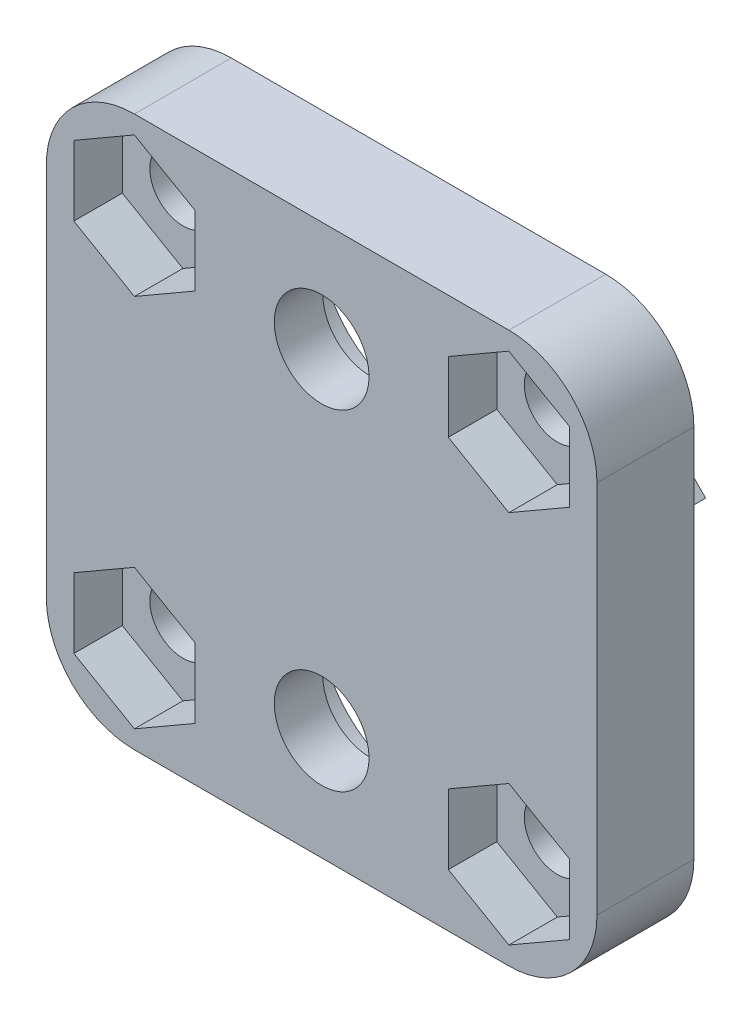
ISO-10303-21;
HEADER;
FILE_DESCRIPTION(('STEP AP214'),'2;1');
FILE_NAME('part.step','',(''),(''),'','','');
FILE_SCHEMA(('AUTOMOTIVE_DESIGN { 1 0 10303 214 1 1 1 1 }'));
ENDSEC;
DATA;
#1=APPLICATION_CONTEXT('core data for automotive mechanical design processes');
#2=APPLICATION_PROTOCOL_DEFINITION('international standard','automotive_design',2000,#1);
#3=PRODUCT_CONTEXT('',#1,'mechanical');
#4=PRODUCT('Part','Part','',(#3));
#5=PRODUCT_RELATED_PRODUCT_CATEGORY('part','',(#4));
#6=PRODUCT_DEFINITION_FORMATION('','',#4);
#7=PRODUCT_DEFINITION_CONTEXT('part definition',#1,'design');
#8=PRODUCT_DEFINITION('design','',#6,#7);
#9=PRODUCT_DEFINITION_SHAPE('','',#8);
#10=(LENGTH_UNIT() NAMED_UNIT(*) SI_UNIT(.MILLI.,.METRE.));
#11=(NAMED_UNIT(*) PLANE_ANGLE_UNIT() SI_UNIT($,.RADIAN.));
#12=(NAMED_UNIT(*) SI_UNIT($,.STERADIAN.) SOLID_ANGLE_UNIT());
#13=UNCERTAINTY_MEASURE_WITH_UNIT(LENGTH_MEASURE(1.E-05),#10,'distance_accuracy_value','');
#14=(GEOMETRIC_REPRESENTATION_CONTEXT(3) GLOBAL_UNCERTAINTY_ASSIGNED_CONTEXT((#13)) GLOBAL_UNIT_ASSIGNED_CONTEXT((#10,
#11,#12)) REPRESENTATION_CONTEXT('',''));
#15=CARTESIAN_POINT('',(0.,0.,0.));
#16=DIRECTION('',(0.,0.,1.));
#17=DIRECTION('',(1.,0.,0.));
#18=AXIS2_PLACEMENT_3D('',#15,#16,#17);
#19=CARTESIAN_POINT('',(17.,17.,-2.2));
#20=DIRECTION('',(0.,0.,1.));
#21=DIRECTION('',(1.,0.,0.));
#22=AXIS2_PLACEMENT_3D('',#19,#20,#21);
#23=PLANE('',#22);
#24=CARTESIAN_POINT('',(17.,17.,-2.2));
#25=DIRECTION('',(0.,0.,1.));
#26=DIRECTION('',(-1.,0.,0.));
#27=AXIS2_PLACEMENT_3D('',#24,#25,#26);
#28=CIRCLE('',#27,4.);
#29=CARTESIAN_POINT('',(13.723391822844,14.7056942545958,-2.2));
#30=VERTEX_POINT('',#29);
#31=CARTESIAN_POINT('',(19.8284271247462,14.1715728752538,-2.2));
#32=VERTEX_POINT('',#31);
#33=EDGE_CURVE('E329',#30,#32,#28,.T.);
#34=ORIENTED_EDGE('',*,*,#33,.F.);
#35=DIRECTION('',(0.819152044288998,0.573576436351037,0.));
#36=VECTOR('',#35,1.);
#37=CARTESIAN_POINT('',(13.723391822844,14.7056942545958,-2.2));
#38=LINE('',#37,#36);
#39=CARTESIAN_POINT('',(12.904239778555,14.1321178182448,-2.2));
#40=VERTEX_POINT('',#39);
#41=EDGE_CURVE('E345',#40,#30,#38,.T.);
#42=ORIENTED_EDGE('',*,*,#41,.F.);
#43=CARTESIAN_POINT('',(17.,17.,-2.2));
#44=DIRECTION('',(0.,0.,-1.));
#45=DIRECTION('',(-1.,0.,0.));
#46=AXIS2_PLACEMENT_3D('',#43,#44,#45);
#47=CIRCLE('',#46,5.);
#48=CARTESIAN_POINT('',(20.5355339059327,13.4644660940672,-2.2));
#49=VERTEX_POINT('',#48);
#50=EDGE_CURVE('E358',#49,#40,#47,.T.);
#51=ORIENTED_EDGE('',*,*,#50,.F.);
#52=DIRECTION('',(0.707106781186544,-0.707106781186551,0.));
#53=VECTOR('',#52,1.);
#54=CARTESIAN_POINT('',(19.8284271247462,14.1715728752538,-2.2));
#55=LINE('',#54,#53);
#56=EDGE_CURVE('E334',#32,#49,#55,.T.);
#57=ORIENTED_EDGE('',*,*,#56,.F.);
#58=EDGE_LOOP('',(#34,#42,#51,#57));
#59=FACE_BOUND('',#58,.T.);
#60=CARTESIAN_POINT('',(8.5,16.,-2.2));
#61=DIRECTION('',(0.,0.,-1.));
#62=DIRECTION('',(-1.,0.,0.));
#63=AXIS2_PLACEMENT_3D('',#60,#61,#62);
#64=CIRCLE('',#63,4.5);
#65=CARTESIAN_POINT('',(4.,16.,-2.2));
#66=VERTEX_POINT('',#65);
#67=EDGE_CURVE('E402',#66,#66,#64,.T.);
#68=ORIENTED_EDGE('',*,*,#67,.F.);
#69=EDGE_LOOP('',(#68));
#70=FACE_BOUND('',#69,.T.);
#71=CARTESIAN_POINT('',(8.49999999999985,1.,-2.2));
#72=DIRECTION('',(0.,0.,-1.));
#73=DIRECTION('',(-1.,0.,0.));
#74=AXIS2_PLACEMENT_3D('',#71,#72,#73);
#75=CIRCLE('',#74,4.5);
#76=CARTESIAN_POINT('',(3.99999999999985,1.,-2.2));
#77=VERTEX_POINT('',#76);
#78=EDGE_CURVE('E406',#77,#77,#75,.T.);
#79=ORIENTED_EDGE('',*,*,#78,.F.);
#80=EDGE_LOOP('',(#79));
#81=FACE_BOUND('',#80,.T.);
#82=CARTESIAN_POINT('',(17.,0.,-2.2));
#83=DIRECTION('',(0.,0.,1.));
#84=DIRECTION('',(1.,0.,0.));
#85=AXIS2_PLACEMENT_3D('',#82,#83,#84);
#86=CIRCLE('',#85,1.5);
#87=CARTESIAN_POINT('',(18.5,0.,-2.2));
#88=VERTEX_POINT('',#87);
#89=EDGE_CURVE('E413',#88,#88,#86,.T.);
#90=ORIENTED_EDGE('',*,*,#89,.T.);
#91=EDGE_LOOP('',(#90));
#92=FACE_BOUND('',#91,.T.);
#93=CARTESIAN_POINT('',(0.,17.,-2.2));
#94=DIRECTION('',(0.,0.,1.));
#95=DIRECTION('',(1.,0.,0.));
#96=AXIS2_PLACEMENT_3D('',#93,#94,#95);
#97=CIRCLE('',#96,1.5);
#98=CARTESIAN_POINT('',(1.5,17.,-2.2));
#99=VERTEX_POINT('',#98);
#100=EDGE_CURVE('E422',#99,#99,#97,.T.);
#101=ORIENTED_EDGE('',*,*,#100,.T.);
#102=EDGE_LOOP('',(#101));
#103=FACE_BOUND('',#102,.T.);
#104=CARTESIAN_POINT('',(0.,0.,-2.2));
#105=DIRECTION('',(0.,0.,1.));
#106=DIRECTION('',(1.,0.,0.));
#107=AXIS2_PLACEMENT_3D('',#104,#105,#106);
#108=CIRCLE('',#107,1.5);
#109=CARTESIAN_POINT('',(1.5,0.,-2.2));
#110=VERTEX_POINT('',#109);
#111=EDGE_CURVE('E430',#110,#110,#108,.T.);
#112=ORIENTED_EDGE('',*,*,#111,.T.);
#113=EDGE_LOOP('',(#112));
#114=FACE_BOUND('',#113,.T.);
#115=CARTESIAN_POINT('',(17.,17.,-2.2));
#116=DIRECTION('',(0.,0.,1.));
#117=DIRECTION('',(1.,0.,0.));
#118=AXIS2_PLACEMENT_3D('',#115,#116,#117);
#119=CIRCLE('',#118,1.5);
#120=CARTESIAN_POINT('',(18.5,17.,-2.2));
#121=VERTEX_POINT('',#120);
#122=EDGE_CURVE('E635',#121,#121,#119,.T.);
#123=ORIENTED_EDGE('',*,*,#122,.T.);
#124=EDGE_LOOP('',(#123));
#125=FACE_BOUND('',#124,.T.);
#126=CARTESIAN_POINT('',(17.,17.,-2.2));
#127=DIRECTION('',(0.,0.,1.));
#128=DIRECTION('',(1.,0.,0.));
#129=AXIS2_PLACEMENT_3D('',#126,#127,#128);
#130=CIRCLE('',#129,4.);
#131=CARTESIAN_POINT('',(21.,17.,-2.2));
#132=VERTEX_POINT('',#131);
#133=CARTESIAN_POINT('',(17.,21.,-2.2));
#134=VERTEX_POINT('',#133);
#135=EDGE_CURVE('E693',#132,#134,#130,.T.);
#136=ORIENTED_EDGE('',*,*,#135,.F.);
#137=DIRECTION('',(0.,1.,0.));
#138=VECTOR('',#137,1.);
#139=CARTESIAN_POINT('',(21.,17.,-2.2));
#140=LINE('',#139,#138);
#141=CARTESIAN_POINT('',(21.,0.,-2.2));
#142=VERTEX_POINT('',#141);
#143=EDGE_CURVE('E714',#142,#132,#140,.T.);
#144=ORIENTED_EDGE('',*,*,#143,.F.);
#145=CARTESIAN_POINT('',(17.,0.,-2.2));
#146=DIRECTION('',(0.,0.,1.));
#147=DIRECTION('',(1.,0.,0.));
#148=AXIS2_PLACEMENT_3D('',#145,#146,#147);
#149=CIRCLE('',#148,4.);
#150=CARTESIAN_POINT('',(17.,-4.,-2.2));
#151=VERTEX_POINT('',#150);
#152=EDGE_CURVE('E754',#151,#142,#149,.T.);
#153=ORIENTED_EDGE('',*,*,#152,.F.);
#154=DIRECTION('',(1.,0.,0.));
#155=VECTOR('',#154,1.);
#156=CARTESIAN_POINT('',(17.,-4.,-2.2));
#157=LINE('',#156,#155);
#158=CARTESIAN_POINT('',(0.,-4.,-2.2));
#159=VERTEX_POINT('',#158);
#160=EDGE_CURVE('E751',#159,#151,#157,.T.);
#161=ORIENTED_EDGE('',*,*,#160,.F.);
#162=CARTESIAN_POINT('',(0.,0.,-2.2));
#163=DIRECTION('',(0.,0.,1.));
#164=DIRECTION('',(1.,0.,0.));
#165=AXIS2_PLACEMENT_3D('',#162,#163,#164);
#166=CIRCLE('',#165,4.);
#167=CARTESIAN_POINT('',(-4.,0.,-2.2));
#168=VERTEX_POINT('',#167);
#169=EDGE_CURVE('E748',#168,#159,#166,.T.);
#170=ORIENTED_EDGE('',*,*,#169,.F.);
#171=DIRECTION('',(0.,-1.,0.));
#172=VECTOR('',#171,1.);
#173=CARTESIAN_POINT('',(-4.,17.,-2.2));
#174=LINE('',#173,#172);
#175=CARTESIAN_POINT('',(-4.,17.,-2.2));
#176=VERTEX_POINT('',#175);
#177=EDGE_CURVE('E745',#176,#168,#174,.T.);
#178=ORIENTED_EDGE('',*,*,#177,.F.);
#179=CARTESIAN_POINT('',(0.,17.,-2.2));
#180=DIRECTION('',(0.,0.,1.));
#181=DIRECTION('',(1.,0.,0.));
#182=AXIS2_PLACEMENT_3D('',#179,#180,#181);
#183=CIRCLE('',#182,4.);
#184=CARTESIAN_POINT('',(0.,21.,-2.2));
#185=VERTEX_POINT('',#184);
#186=EDGE_CURVE('E742',#185,#176,#183,.T.);
#187=ORIENTED_EDGE('',*,*,#186,.F.);
#188=DIRECTION('',(-1.,0.,0.));
#189=VECTOR('',#188,1.);
#190=CARTESIAN_POINT('',(17.,21.,-2.2));
#191=LINE('',#190,#189);
#192=EDGE_CURVE('E739',#134,#185,#191,.T.);
#193=ORIENTED_EDGE('',*,*,#192,.F.);
#194=EDGE_LOOP('',(#136,#144,#153,#161,#170,#178,#187,#193));
#195=FACE_BOUND('',#194,.T.);
#196=CARTESIAN_POINT('',(0.,0.,-2.2));
#197=DIRECTION('',(0.,0.,1.));
#198=DIRECTION('',(1.,0.,0.));
#199=AXIS2_PLACEMENT_3D('',#196,#197,#198);
#200=CIRCLE('',#199,4.);
#201=CARTESIAN_POINT('',(3.27660817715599,2.29430574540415,-2.2));
#202=VERTEX_POINT('',#201);
#203=CARTESIAN_POINT('',(-2.82842712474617,2.8284271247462,-2.2));
#204=VERTEX_POINT('',#203);
#205=EDGE_CURVE('E327',#202,#204,#200,.T.);
#206=ORIENTED_EDGE('',*,*,#205,.F.);
#207=DIRECTION('',(-0.819152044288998,-0.573576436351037,0.));
#208=VECTOR('',#207,1.);
#209=CARTESIAN_POINT('',(3.27660817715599,2.29430574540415,-2.2));
#210=LINE('',#209,#208);
#211=CARTESIAN_POINT('',(4.09576022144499,2.86788218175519,-2.2));
#212=VERTEX_POINT('',#211);
#213=EDGE_CURVE('E324',#212,#202,#210,.T.);
#214=ORIENTED_EDGE('',*,*,#213,.F.);
#215=CARTESIAN_POINT('',(0.,0.,-2.2));
#216=DIRECTION('',(0.,0.,-1.));
#217=DIRECTION('',(1.,0.,0.));
#218=AXIS2_PLACEMENT_3D('',#215,#216,#217);
#219=CIRCLE('',#218,5.);
#220=CARTESIAN_POINT('',(-3.53553390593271,3.53553390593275,-2.2));
#221=VERTEX_POINT('',#220);
#222=EDGE_CURVE('E68',#221,#212,#219,.T.);
#223=ORIENTED_EDGE('',*,*,#222,.F.);
#224=DIRECTION('',(-0.707106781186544,0.707106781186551,0.));
#225=VECTOR('',#224,1.);
#226=CARTESIAN_POINT('',(-2.82842712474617,2.8284271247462,-2.2));
#227=LINE('',#226,#225);
#228=EDGE_CURVE('E63',#204,#221,#227,.T.);
#229=ORIENTED_EDGE('',*,*,#228,.F.);
#230=EDGE_LOOP('',(#206,#214,#223,#229));
#231=FACE_BOUND('',#230,.T.);
#232=ADVANCED_FACE('F47',(#59,#70,#81,#92,#103,#114,#125,#195,#231),#23,.F.);
#233=CARTESIAN_POINT('',(17.,17.,2.2));
#234=DIRECTION('',(0.,0.,-1.));
#235=DIRECTION('',(-1.,0.,0.));
#236=AXIS2_PLACEMENT_3D('',#233,#234,#235);
#237=CYLINDRICAL_SURFACE('',#236,4.);
#238=ORIENTED_EDGE('',*,*,#135,.T.);
#239=DIRECTION('',(0.,0.,-1.));
#240=VECTOR('',#239,1.);
#241=CARTESIAN_POINT('',(17.,21.,2.2));
#242=LINE('',#241,#240);
#243=CARTESIAN_POINT('',(17.,21.,2.2));
#244=VERTEX_POINT('',#243);
#245=EDGE_CURVE('E11',#244,#134,#242,.T.);
#246=ORIENTED_EDGE('',*,*,#245,.F.);
#247=CARTESIAN_POINT('',(17.,17.,2.2));
#248=DIRECTION('',(0.,0.,1.));
#249=DIRECTION('',(1.,0.,0.));
#250=AXIS2_PLACEMENT_3D('',#247,#248,#249);
#251=CIRCLE('',#250,4.);
#252=CARTESIAN_POINT('',(21.,17.,2.2));
#253=VERTEX_POINT('',#252);
#254=EDGE_CURVE('E709',#253,#244,#251,.T.);
#255=ORIENTED_EDGE('',*,*,#254,.F.);
#256=DIRECTION('',(0.,0.,-1.));
#257=VECTOR('',#256,1.);
#258=CARTESIAN_POINT('',(21.,17.,2.2));
#259=LINE('',#258,#257);
#260=EDGE_CURVE('E735',#253,#132,#259,.T.);
#261=ORIENTED_EDGE('',*,*,#260,.T.);
#262=EDGE_LOOP('',(#238,#246,#255,#261));
#263=FACE_BOUND('',#262,.T.);
#264=ADVANCED_FACE('F49',(#263),#237,.T.);
#265=CARTESIAN_POINT('',(17.,21.,2.2));
#266=DIRECTION('',(0.,-1.,0.));
#267=DIRECTION('',(1.,0.,0.));
#268=AXIS2_PLACEMENT_3D('',#265,#266,#267);
#269=PLANE('',#268);
#270=ORIENTED_EDGE('',*,*,#192,.T.);
#271=DIRECTION('',(0.,0.,-1.));
#272=VECTOR('',#271,1.);
#273=CARTESIAN_POINT('',(0.,21.,2.2));
#274=LINE('',#273,#272);
#275=CARTESIAN_POINT('',(0.,21.,2.2));
#276=VERTEX_POINT('',#275);
#277=EDGE_CURVE('E56',#276,#185,#274,.T.);
#278=ORIENTED_EDGE('',*,*,#277,.F.);
#279=DIRECTION('',(-1.,0.,0.));
#280=VECTOR('',#279,1.);
#281=CARTESIAN_POINT('',(17.,21.,2.2));
#282=LINE('',#281,#280);
#283=EDGE_CURVE('E713',#244,#276,#282,.T.);
#284=ORIENTED_EDGE('',*,*,#283,.F.);
#285=ORIENTED_EDGE('',*,*,#245,.T.);
#286=EDGE_LOOP('',(#270,#278,#284,#285));
#287=FACE_BOUND('',#286,.T.);
#288=ADVANCED_FACE('F809',(#287),#269,.F.);
#289=CARTESIAN_POINT('',(0.,17.,2.2));
#290=DIRECTION('',(0.,0.,-1.));
#291=DIRECTION('',(-1.,0.,0.));
#292=AXIS2_PLACEMENT_3D('',#289,#290,#291);
#293=CYLINDRICAL_SURFACE('',#292,4.);
#294=ORIENTED_EDGE('',*,*,#186,.T.);
#295=DIRECTION('',(0.,0.,-1.));
#296=VECTOR('',#295,1.);
#297=CARTESIAN_POINT('',(-4.,17.,2.2));
#298=LINE('',#297,#296);
#299=CARTESIAN_POINT('',(-4.,17.,2.2));
#300=VERTEX_POINT('',#299);
#301=EDGE_CURVE('E778',#300,#176,#298,.T.);
#302=ORIENTED_EDGE('',*,*,#301,.F.);
#303=CARTESIAN_POINT('',(0.,17.,2.2));
#304=DIRECTION('',(0.,0.,1.));
#305=DIRECTION('',(1.,0.,0.));
#306=AXIS2_PLACEMENT_3D('',#303,#304,#305);
#307=CIRCLE('',#306,4.);
#308=EDGE_CURVE('E717',#276,#300,#307,.T.);
#309=ORIENTED_EDGE('',*,*,#308,.F.);
#310=ORIENTED_EDGE('',*,*,#277,.T.);
#311=EDGE_LOOP('',(#294,#302,#309,#310));
#312=FACE_BOUND('',#311,.T.);
#313=ADVANCED_FACE('F787',(#312),#293,.T.);
#314=CARTESIAN_POINT('',(-4.,17.,2.2));
#315=DIRECTION('',(1.,0.,0.));
#316=DIRECTION('',(0.,1.,0.));
#317=AXIS2_PLACEMENT_3D('',#314,#315,#316);
#318=PLANE('',#317);
#319=ORIENTED_EDGE('',*,*,#177,.T.);
#320=DIRECTION('',(0.,0.,-1.));
#321=VECTOR('',#320,1.);
#322=CARTESIAN_POINT('',(-4.,0.,2.2));
#323=LINE('',#322,#321);
#324=CARTESIAN_POINT('',(-4.,0.,2.2));
#325=VERTEX_POINT('',#324);
#326=EDGE_CURVE('E774',#325,#168,#323,.T.);
#327=ORIENTED_EDGE('',*,*,#326,.F.);
#328=DIRECTION('',(0.,-1.,0.));
#329=VECTOR('',#328,1.);
#330=CARTESIAN_POINT('',(-4.,17.,2.2));
#331=LINE('',#330,#329);
#332=EDGE_CURVE('E720',#300,#325,#331,.T.);
#333=ORIENTED_EDGE('',*,*,#332,.F.);
#334=ORIENTED_EDGE('',*,*,#301,.T.);
#335=EDGE_LOOP('',(#319,#327,#333,#334));
#336=FACE_BOUND('',#335,.T.);
#337=ADVANCED_FACE('F797',(#336),#318,.F.);
#338=CARTESIAN_POINT('',(0.,0.,2.2));
#339=DIRECTION('',(0.,0.,-1.));
#340=DIRECTION('',(-1.,0.,0.));
#341=AXIS2_PLACEMENT_3D('',#338,#339,#340);
#342=CYLINDRICAL_SURFACE('',#341,4.);
#343=ORIENTED_EDGE('',*,*,#169,.T.);
#344=DIRECTION('',(0.,0.,-1.));
#345=VECTOR('',#344,1.);
#346=CARTESIAN_POINT('',(0.,-4.,2.2));
#347=LINE('',#346,#345);
#348=CARTESIAN_POINT('',(0.,-4.,2.2));
#349=VERTEX_POINT('',#348);
#350=EDGE_CURVE('E770',#349,#159,#347,.T.);
#351=ORIENTED_EDGE('',*,*,#350,.F.);
#352=CARTESIAN_POINT('',(0.,0.,2.2));
#353=DIRECTION('',(0.,0.,1.));
#354=DIRECTION('',(1.,0.,0.));
#355=AXIS2_PLACEMENT_3D('',#352,#353,#354);
#356=CIRCLE('',#355,4.);
#357=EDGE_CURVE('E723',#325,#349,#356,.T.);
#358=ORIENTED_EDGE('',*,*,#357,.F.);
#359=ORIENTED_EDGE('',*,*,#326,.T.);
#360=EDGE_LOOP('',(#343,#351,#358,#359));
#361=FACE_BOUND('',#360,.T.);
#362=ADVANCED_FACE('F801',(#361),#342,.T.);
#363=CARTESIAN_POINT('',(17.,-4.,2.2));
#364=DIRECTION('',(0.,1.,0.));
#365=DIRECTION('',(-1.,0.,0.));
#366=AXIS2_PLACEMENT_3D('',#363,#364,#365);
#367=PLANE('',#366);
#368=ORIENTED_EDGE('',*,*,#160,.T.);
#369=DIRECTION('',(0.,0.,-1.));
#370=VECTOR('',#369,1.);
#371=CARTESIAN_POINT('',(17.,-4.,2.2));
#372=LINE('',#371,#370);
#373=CARTESIAN_POINT('',(17.,-4.,2.2));
#374=VERTEX_POINT('',#373);
#375=EDGE_CURVE('E766',#374,#151,#372,.T.);
#376=ORIENTED_EDGE('',*,*,#375,.F.);
#377=DIRECTION('',(1.,0.,0.));
#378=VECTOR('',#377,1.);
#379=CARTESIAN_POINT('',(17.,-4.,2.2));
#380=LINE('',#379,#378);
#381=EDGE_CURVE('E726',#349,#374,#380,.T.);
#382=ORIENTED_EDGE('',*,*,#381,.F.);
#383=ORIENTED_EDGE('',*,*,#350,.T.);
#384=EDGE_LOOP('',(#368,#376,#382,#383));
#385=FACE_BOUND('',#384,.T.);
#386=ADVANCED_FACE('F822',(#385),#367,.F.);
#387=CARTESIAN_POINT('',(17.,0.,2.2));
#388=DIRECTION('',(0.,0.,-1.));
#389=DIRECTION('',(-1.,0.,0.));
#390=AXIS2_PLACEMENT_3D('',#387,#388,#389);
#391=CYLINDRICAL_SURFACE('',#390,4.);
#392=ORIENTED_EDGE('',*,*,#152,.T.);
#393=DIRECTION('',(0.,0.,-1.));
#394=VECTOR('',#393,1.);
#395=CARTESIAN_POINT('',(21.,0.,2.2));
#396=LINE('',#395,#394);
#397=CARTESIAN_POINT('',(21.,0.,2.2));
#398=VERTEX_POINT('',#397);
#399=EDGE_CURVE('E762',#398,#142,#396,.T.);
#400=ORIENTED_EDGE('',*,*,#399,.F.);
#401=CARTESIAN_POINT('',(17.,0.,2.2));
#402=DIRECTION('',(0.,0.,1.));
#403=DIRECTION('',(1.,0.,0.));
#404=AXIS2_PLACEMENT_3D('',#401,#402,#403);
#405=CIRCLE('',#404,4.);
#406=EDGE_CURVE('E729',#374,#398,#405,.T.);
#407=ORIENTED_EDGE('',*,*,#406,.F.);
#408=ORIENTED_EDGE('',*,*,#375,.T.);
#409=EDGE_LOOP('',(#392,#400,#407,#408));
#410=FACE_BOUND('',#409,.T.);
#411=ADVANCED_FACE('F820',(#410),#391,.T.);
#412=CARTESIAN_POINT('',(21.,17.,2.2));
#413=DIRECTION('',(-1.,0.,0.));
#414=DIRECTION('',(0.,-1.,0.));
#415=AXIS2_PLACEMENT_3D('',#412,#413,#414);
#416=PLANE('',#415);
#417=ORIENTED_EDGE('',*,*,#143,.T.);
#418=ORIENTED_EDGE('',*,*,#260,.F.);
#419=DIRECTION('',(0.,1.,0.));
#420=VECTOR('',#419,1.);
#421=CARTESIAN_POINT('',(21.,17.,2.2));
#422=LINE('',#421,#420);
#423=EDGE_CURVE('E732',#398,#253,#422,.T.);
#424=ORIENTED_EDGE('',*,*,#423,.F.);
#425=ORIENTED_EDGE('',*,*,#399,.T.);
#426=EDGE_LOOP('',(#417,#418,#424,#425));
#427=FACE_BOUND('',#426,.T.);
#428=ADVANCED_FACE('F815',(#427),#416,.F.);
#429=CARTESIAN_POINT('',(17.,17.,2.2));
#430=DIRECTION('',(0.,0.,1.));
#431=DIRECTION('',(1.,0.,0.));
#432=AXIS2_PLACEMENT_3D('',#429,#430,#431);
#433=PLANE('',#432);
#434=CARTESIAN_POINT('',(8.5,16.,2.2));
#435=DIRECTION('',(0.,0.,-1.));
#436=DIRECTION('',(-1.,0.,0.));
#437=AXIS2_PLACEMENT_3D('',#434,#435,#436);
#438=CIRCLE('',#437,2.15);
#439=CARTESIAN_POINT('',(6.35,16.,2.2));
#440=VERTEX_POINT('',#439);
#441=EDGE_CURVE('E381',#440,#440,#438,.T.);
#442=ORIENTED_EDGE('',*,*,#441,.T.);
#443=EDGE_LOOP('',(#442));
#444=FACE_BOUND('',#443,.T.);
#445=CARTESIAN_POINT('',(8.49999999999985,1.,2.2));
#446=DIRECTION('',(0.,0.,-1.));
#447=DIRECTION('',(-1.,0.,0.));
#448=AXIS2_PLACEMENT_3D('',#445,#446,#447);
#449=CIRCLE('',#448,2.15);
#450=CARTESIAN_POINT('',(6.34999999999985,1.,2.2));
#451=VERTEX_POINT('',#450);
#452=EDGE_CURVE('E380',#451,#451,#449,.T.);
#453=ORIENTED_EDGE('',*,*,#452,.T.);
#454=EDGE_LOOP('',(#453));
#455=FACE_BOUND('',#454,.T.);
#456=DIRECTION('',(0.866025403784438,0.500000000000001,0.));
#457=VECTOR('',#456,1.);
#458=CARTESIAN_POINT('',(17.,-3.17542648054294,2.2));
#459=LINE('',#458,#457);
#460=CARTESIAN_POINT('',(17.,-3.17542648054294,2.2));
#461=VERTEX_POINT('',#460);
#462=CARTESIAN_POINT('',(19.75,-1.58771324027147,2.2));
#463=VERTEX_POINT('',#462);
#464=EDGE_CURVE('E463',#461,#463,#459,.T.);
#465=ORIENTED_EDGE('',*,*,#464,.F.);
#466=DIRECTION('',(0.866025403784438,-0.5,0.));
#467=VECTOR('',#466,1.);
#468=CARTESIAN_POINT('',(14.25,-1.58771324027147,2.2));
#469=LINE('',#468,#467);
#470=CARTESIAN_POINT('',(14.25,-1.58771324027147,2.2));
#471=VERTEX_POINT('',#470);
#472=EDGE_CURVE('E442',#471,#461,#469,.T.);
#473=ORIENTED_EDGE('',*,*,#472,.F.);
#474=DIRECTION('',(0.,-1.,0.));
#475=VECTOR('',#474,1.);
#476=CARTESIAN_POINT('',(14.25,1.58771324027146,2.2));
#477=LINE('',#476,#475);
#478=CARTESIAN_POINT('',(14.25,1.58771324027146,2.2));
#479=VERTEX_POINT('',#478);
#480=EDGE_CURVE('E479',#479,#471,#477,.T.);
#481=ORIENTED_EDGE('',*,*,#480,.F.);
#482=DIRECTION('',(-0.866025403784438,-0.5,0.));
#483=VECTOR('',#482,1.);
#484=CARTESIAN_POINT('',(17.,3.17542648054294,2.2));
#485=LINE('',#484,#483);
#486=CARTESIAN_POINT('',(17.,3.17542648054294,2.2));
#487=VERTEX_POINT('',#486);
#488=EDGE_CURVE('E475',#487,#479,#485,.T.);
#489=ORIENTED_EDGE('',*,*,#488,.F.);
#490=DIRECTION('',(-0.866025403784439,0.5,0.));
#491=VECTOR('',#490,1.);
#492=CARTESIAN_POINT('',(19.75,1.58771324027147,2.2));
#493=LINE('',#492,#491);
#494=CARTESIAN_POINT('',(19.75,1.58771324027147,2.2));
#495=VERTEX_POINT('',#494);
#496=EDGE_CURVE('E471',#495,#487,#493,.T.);
#497=ORIENTED_EDGE('',*,*,#496,.F.);
#498=DIRECTION('',(0.,1.,0.));
#499=VECTOR('',#498,1.);
#500=CARTESIAN_POINT('',(19.75,-1.58771324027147,2.2));
#501=LINE('',#500,#499);
#502=EDGE_CURVE('E466',#463,#495,#501,.T.);
#503=ORIENTED_EDGE('',*,*,#502,.F.);
#504=EDGE_LOOP('',(#465,#473,#481,#489,#497,#503));
#505=FACE_BOUND('',#504,.T.);
#506=DIRECTION('',(0.866025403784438,0.500000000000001,0.));
#507=VECTOR('',#506,1.);
#508=CARTESIAN_POINT('',(0.,13.8245735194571,2.2));
#509=LINE('',#508,#507);
#510=CARTESIAN_POINT('',(0.,13.8245735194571,2.2));
#511=VERTEX_POINT('',#510);
#512=CARTESIAN_POINT('',(2.75,15.4122867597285,2.2));
#513=VERTEX_POINT('',#512);
#514=EDGE_CURVE('E531',#511,#513,#509,.T.);
#515=ORIENTED_EDGE('',*,*,#514,.F.);
#516=DIRECTION('',(0.866025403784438,-0.5,0.));
#517=VECTOR('',#516,1.);
#518=CARTESIAN_POINT('',(-2.75,15.4122867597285,2.2));
#519=LINE('',#518,#517);
#520=CARTESIAN_POINT('',(-2.75,15.4122867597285,2.2));
#521=VERTEX_POINT('',#520);
#522=EDGE_CURVE('E510',#521,#511,#519,.T.);
#523=ORIENTED_EDGE('',*,*,#522,.F.);
#524=DIRECTION('',(0.,-1.,0.));
#525=VECTOR('',#524,1.);
#526=CARTESIAN_POINT('',(-2.75,18.5877132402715,2.2));
#527=LINE('',#526,#525);
#528=CARTESIAN_POINT('',(-2.75,18.5877132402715,2.2));
#529=VERTEX_POINT('',#528);
#530=EDGE_CURVE('E547',#529,#521,#527,.T.);
#531=ORIENTED_EDGE('',*,*,#530,.F.);
#532=DIRECTION('',(-0.866025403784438,-0.5,0.));
#533=VECTOR('',#532,1.);
#534=CARTESIAN_POINT('',(0.,20.1754264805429,2.2));
#535=LINE('',#534,#533);
#536=CARTESIAN_POINT('',(0.,20.1754264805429,2.2));
#537=VERTEX_POINT('',#536);
#538=EDGE_CURVE('E543',#537,#529,#535,.T.);
#539=ORIENTED_EDGE('',*,*,#538,.F.);
#540=DIRECTION('',(-0.866025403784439,0.5,0.));
#541=VECTOR('',#540,1.);
#542=CARTESIAN_POINT('',(2.75,18.5877132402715,2.2));
#543=LINE('',#542,#541);
#544=CARTESIAN_POINT('',(2.75,18.5877132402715,2.2));
#545=VERTEX_POINT('',#544);
#546=EDGE_CURVE('E539',#545,#537,#543,.T.);
#547=ORIENTED_EDGE('',*,*,#546,.F.);
#548=DIRECTION('',(0.,1.,0.));
#549=VECTOR('',#548,1.);
#550=CARTESIAN_POINT('',(2.75,15.4122867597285,2.2));
#551=LINE('',#550,#549);
#552=EDGE_CURVE('E534',#513,#545,#551,.T.);
#553=ORIENTED_EDGE('',*,*,#552,.F.);
#554=EDGE_LOOP('',(#515,#523,#531,#539,#547,#553));
#555=FACE_BOUND('',#554,.T.);
#556=DIRECTION('',(0.866025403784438,0.500000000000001,0.));
#557=VECTOR('',#556,1.);
#558=CARTESIAN_POINT('',(0.,-3.17542648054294,2.2));
#559=LINE('',#558,#557);
#560=CARTESIAN_POINT('',(0.,-3.17542648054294,2.2));
#561=VERTEX_POINT('',#560);
#562=CARTESIAN_POINT('',(2.75,-1.58771324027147,2.2));
#563=VERTEX_POINT('',#562);
#564=EDGE_CURVE('E417',#561,#563,#559,.T.);
#565=ORIENTED_EDGE('',*,*,#564,.F.);
#566=DIRECTION('',(0.866025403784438,-0.5,0.));
#567=VECTOR('',#566,1.);
#568=CARTESIAN_POINT('',(-2.75,-1.58771324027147,2.2));
#569=LINE('',#568,#567);
#570=CARTESIAN_POINT('',(-2.75,-1.58771324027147,2.2));
#571=VERTEX_POINT('',#570);
#572=EDGE_CURVE('E576',#571,#561,#569,.T.);
#573=ORIENTED_EDGE('',*,*,#572,.F.);
#574=DIRECTION('',(0.,-1.,0.));
#575=VECTOR('',#574,1.);
#576=CARTESIAN_POINT('',(-2.75,1.58771324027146,2.2));
#577=LINE('',#576,#575);
#578=CARTESIAN_POINT('',(-2.75,1.58771324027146,2.2));
#579=VERTEX_POINT('',#578);
#580=EDGE_CURVE('E611',#579,#571,#577,.T.);
#581=ORIENTED_EDGE('',*,*,#580,.F.);
#582=DIRECTION('',(-0.866025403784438,-0.5,0.));
#583=VECTOR('',#582,1.);
#584=CARTESIAN_POINT('',(0.,3.17542648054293,2.2));
#585=LINE('',#584,#583);
#586=CARTESIAN_POINT('',(0.,3.17542648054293,2.2));
#587=VERTEX_POINT('',#586);
#588=EDGE_CURVE('E607',#587,#579,#585,.T.);
#589=ORIENTED_EDGE('',*,*,#588,.F.);
#590=DIRECTION('',(-0.866025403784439,0.5,0.));
#591=VECTOR('',#590,1.);
#592=CARTESIAN_POINT('',(2.75,1.58771324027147,2.2));
#593=LINE('',#592,#591);
#594=CARTESIAN_POINT('',(2.75,1.58771324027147,2.2));
#595=VERTEX_POINT('',#594);
#596=EDGE_CURVE('E603',#595,#587,#593,.T.);
#597=ORIENTED_EDGE('',*,*,#596,.F.);
#598=DIRECTION('',(0.,1.,0.));
#599=VECTOR('',#598,1.);
#600=CARTESIAN_POINT('',(2.75,-1.58771324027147,2.2));
#601=LINE('',#600,#599);
#602=EDGE_CURVE('E599',#563,#595,#601,.T.);
#603=ORIENTED_EDGE('',*,*,#602,.F.);
#604=EDGE_LOOP('',(#565,#573,#581,#589,#597,#603));
#605=FACE_BOUND('',#604,.T.);
#606=DIRECTION('',(0.866025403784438,0.500000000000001,0.));
#607=VECTOR('',#606,1.);
#608=CARTESIAN_POINT('',(17.,13.8245735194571,2.2));
#609=LINE('',#608,#607);
#610=CARTESIAN_POINT('',(17.,13.8245735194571,2.2));
#611=VERTEX_POINT('',#610);
#612=CARTESIAN_POINT('',(19.75,15.4122867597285,2.2));
#613=VERTEX_POINT('',#612);
#614=EDGE_CURVE('E639',#611,#613,#609,.T.);
#615=ORIENTED_EDGE('',*,*,#614,.F.);
#616=DIRECTION('',(0.866025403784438,-0.5,0.));
#617=VECTOR('',#616,1.);
#618=CARTESIAN_POINT('',(14.25,15.4122867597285,2.2));
#619=LINE('',#618,#617);
#620=CARTESIAN_POINT('',(14.25,15.4122867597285,2.2));
#621=VERTEX_POINT('',#620);
#622=EDGE_CURVE('E648',#621,#611,#619,.T.);
#623=ORIENTED_EDGE('',*,*,#622,.F.);
#624=DIRECTION('',(0.,-1.,0.));
#625=VECTOR('',#624,1.);
#626=CARTESIAN_POINT('',(14.25,18.5877132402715,2.2));
#627=LINE('',#626,#625);
#628=CARTESIAN_POINT('',(14.25,18.5877132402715,2.2));
#629=VERTEX_POINT('',#628);
#630=EDGE_CURVE('E683',#629,#621,#627,.T.);
#631=ORIENTED_EDGE('',*,*,#630,.F.);
#632=DIRECTION('',(-0.866025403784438,-0.5,0.));
#633=VECTOR('',#632,1.);
#634=CARTESIAN_POINT('',(17.,20.1754264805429,2.2));
#635=LINE('',#634,#633);
#636=CARTESIAN_POINT('',(17.,20.1754264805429,2.2));
#637=VERTEX_POINT('',#636);
#638=EDGE_CURVE('E679',#637,#629,#635,.T.);
#639=ORIENTED_EDGE('',*,*,#638,.F.);
#640=DIRECTION('',(-0.866025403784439,0.5,0.));
#641=VECTOR('',#640,1.);
#642=CARTESIAN_POINT('',(19.75,18.5877132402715,2.2));
#643=LINE('',#642,#641);
#644=CARTESIAN_POINT('',(19.75,18.5877132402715,2.2));
#645=VERTEX_POINT('',#644);
#646=EDGE_CURVE('E675',#645,#637,#643,.T.);
#647=ORIENTED_EDGE('',*,*,#646,.F.);
#648=DIRECTION('',(0.,1.,0.));
#649=VECTOR('',#648,1.);
#650=CARTESIAN_POINT('',(19.75,15.4122867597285,2.2));
#651=LINE('',#650,#649);
#652=EDGE_CURVE('E671',#613,#645,#651,.T.);
#653=ORIENTED_EDGE('',*,*,#652,.F.);
#654=EDGE_LOOP('',(#615,#623,#631,#639,#647,#653));
#655=FACE_BOUND('',#654,.T.);
#656=ORIENTED_EDGE('',*,*,#254,.T.);
#657=ORIENTED_EDGE('',*,*,#283,.T.);
#658=ORIENTED_EDGE('',*,*,#308,.T.);
#659=ORIENTED_EDGE('',*,*,#332,.T.);
#660=ORIENTED_EDGE('',*,*,#357,.T.);
#661=ORIENTED_EDGE('',*,*,#381,.T.);
#662=ORIENTED_EDGE('',*,*,#406,.T.);
#663=ORIENTED_EDGE('',*,*,#423,.T.);
#664=EDGE_LOOP('',(#656,#657,#658,#659,#660,#661,#662,#663));
#665=FACE_BOUND('',#664,.T.);
#666=ADVANCED_FACE('F805',(#444,#455,#505,#555,#605,#655,#665),#433,.T.);
#667=CARTESIAN_POINT('',(17.,13.8245735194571,0.));
#668=DIRECTION('',(0.500000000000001,-0.866025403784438,0.));
#669=DIRECTION('',(0.866025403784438,0.500000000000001,0.));
#670=AXIS2_PLACEMENT_3D('',#667,#668,#669);
#671=PLANE('',#670);
#672=ORIENTED_EDGE('',*,*,#614,.T.);
#673=DIRECTION('',(0.,0.,1.));
#674=VECTOR('',#673,1.);
#675=CARTESIAN_POINT('',(19.75,15.4122867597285,0.));
#676=LINE('',#675,#674);
#677=CARTESIAN_POINT('',(19.75,15.4122867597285,0.));
#678=VERTEX_POINT('',#677);
#679=EDGE_CURVE('E668',#678,#613,#676,.T.);
#680=ORIENTED_EDGE('',*,*,#679,.F.);
#681=DIRECTION('',(0.866025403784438,0.500000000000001,0.));
#682=VECTOR('',#681,1.);
#683=CARTESIAN_POINT('',(17.,13.8245735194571,0.));
#684=LINE('',#683,#682);
#685=CARTESIAN_POINT('',(17.,13.8245735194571,0.));
#686=VERTEX_POINT('',#685);
#687=EDGE_CURVE('E643',#686,#678,#684,.T.);
#688=ORIENTED_EDGE('',*,*,#687,.F.);
#689=DIRECTION('',(0.,0.,1.));
#690=VECTOR('',#689,1.);
#691=CARTESIAN_POINT('',(17.,13.8245735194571,0.));
#692=LINE('',#691,#690);
#693=EDGE_CURVE('E690',#686,#611,#692,.T.);
#694=ORIENTED_EDGE('',*,*,#693,.T.);
#695=EDGE_LOOP('',(#672,#680,#688,#694));
#696=FACE_BOUND('',#695,.T.);
#697=ADVANCED_FACE('F848',(#696),#671,.F.);
#698=CARTESIAN_POINT('',(14.25,15.4122867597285,0.));
#699=DIRECTION('',(-0.5,-0.866025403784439,0.));
#700=DIRECTION('',(0.866025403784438,-0.5,0.));
#701=AXIS2_PLACEMENT_3D('',#698,#699,#700);
#702=PLANE('',#701);
#703=ORIENTED_EDGE('',*,*,#622,.T.);
#704=ORIENTED_EDGE('',*,*,#693,.F.);
#705=DIRECTION('',(0.866025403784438,-0.5,0.));
#706=VECTOR('',#705,1.);
#707=CARTESIAN_POINT('',(14.25,15.4122867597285,0.));
#708=LINE('',#707,#706);
#709=CARTESIAN_POINT('',(14.25,15.4122867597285,0.));
#710=VERTEX_POINT('',#709);
#711=EDGE_CURVE('E664',#710,#686,#708,.T.);
#712=ORIENTED_EDGE('',*,*,#711,.F.);
#713=DIRECTION('',(0.,0.,1.));
#714=VECTOR('',#713,1.);
#715=CARTESIAN_POINT('',(14.25,15.4122867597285,0.));
#716=LINE('',#715,#714);
#717=EDGE_CURVE('E694',#710,#621,#716,.T.);
#718=ORIENTED_EDGE('',*,*,#717,.T.);
#719=EDGE_LOOP('',(#703,#704,#712,#718));
#720=FACE_BOUND('',#719,.T.);
#721=ADVANCED_FACE('F854',(#720),#702,.F.);
#722=CARTESIAN_POINT('',(14.25,18.5877132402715,0.));
#723=DIRECTION('',(-1.,0.,0.));
#724=DIRECTION('',(0.,-1.,0.));
#725=AXIS2_PLACEMENT_3D('',#722,#723,#724);
#726=PLANE('',#725);
#727=ORIENTED_EDGE('',*,*,#630,.T.);
#728=ORIENTED_EDGE('',*,*,#717,.F.);
#729=DIRECTION('',(0.,-1.,0.));
#730=VECTOR('',#729,1.);
#731=CARTESIAN_POINT('',(14.25,18.5877132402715,0.));
#732=LINE('',#731,#730);
#733=CARTESIAN_POINT('',(14.25,18.5877132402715,0.));
#734=VERTEX_POINT('',#733);
#735=EDGE_CURVE('E660',#734,#710,#732,.T.);
#736=ORIENTED_EDGE('',*,*,#735,.F.);
#737=DIRECTION('',(0.,0.,1.));
#738=VECTOR('',#737,1.);
#739=CARTESIAN_POINT('',(14.25,18.5877132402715,0.));
#740=LINE('',#739,#738);
#741=EDGE_CURVE('E697',#734,#629,#740,.T.);
#742=ORIENTED_EDGE('',*,*,#741,.T.);
#743=EDGE_LOOP('',(#727,#728,#736,#742));
#744=FACE_BOUND('',#743,.T.);
#745=ADVANCED_FACE('F888',(#744),#726,.F.);
#746=CARTESIAN_POINT('',(17.,20.1754264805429,0.));
#747=DIRECTION('',(-0.5,0.866025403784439,0.));
#748=DIRECTION('',(-0.866025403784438,-0.5,0.));
#749=AXIS2_PLACEMENT_3D('',#746,#747,#748);
#750=PLANE('',#749);
#751=ORIENTED_EDGE('',*,*,#638,.T.);
#752=ORIENTED_EDGE('',*,*,#741,.F.);
#753=DIRECTION('',(-0.866025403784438,-0.5,0.));
#754=VECTOR('',#753,1.);
#755=CARTESIAN_POINT('',(17.,20.1754264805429,0.));
#756=LINE('',#755,#754);
#757=CARTESIAN_POINT('',(17.,20.1754264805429,0.));
#758=VERTEX_POINT('',#757);
#759=EDGE_CURVE('E656',#758,#734,#756,.T.);
#760=ORIENTED_EDGE('',*,*,#759,.F.);
#761=DIRECTION('',(0.,0.,1.));
#762=VECTOR('',#761,1.);
#763=CARTESIAN_POINT('',(17.,20.1754264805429,0.));
#764=LINE('',#763,#762);
#765=EDGE_CURVE('E700',#758,#637,#764,.T.);
#766=ORIENTED_EDGE('',*,*,#765,.T.);
#767=EDGE_LOOP('',(#751,#752,#760,#766));
#768=FACE_BOUND('',#767,.T.);
#769=ADVANCED_FACE('F891',(#768),#750,.F.);
#770=CARTESIAN_POINT('',(19.75,18.5877132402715,0.));
#771=DIRECTION('',(0.5,0.866025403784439,0.));
#772=DIRECTION('',(-0.866025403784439,0.5,0.));
#773=AXIS2_PLACEMENT_3D('',#770,#771,#772);
#774=PLANE('',#773);
#775=ORIENTED_EDGE('',*,*,#646,.T.);
#776=ORIENTED_EDGE('',*,*,#765,.F.);
#777=DIRECTION('',(-0.866025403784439,0.5,0.));
#778=VECTOR('',#777,1.);
#779=CARTESIAN_POINT('',(19.75,18.5877132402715,0.));
#780=LINE('',#779,#778);
#781=CARTESIAN_POINT('',(19.75,18.5877132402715,0.));
#782=VERTEX_POINT('',#781);
#783=EDGE_CURVE('E652',#782,#758,#780,.T.);
#784=ORIENTED_EDGE('',*,*,#783,.F.);
#785=DIRECTION('',(0.,0.,1.));
#786=VECTOR('',#785,1.);
#787=CARTESIAN_POINT('',(19.75,18.5877132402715,0.));
#788=LINE('',#787,#786);
#789=EDGE_CURVE('E703',#782,#645,#788,.T.);
#790=ORIENTED_EDGE('',*,*,#789,.T.);
#791=EDGE_LOOP('',(#775,#776,#784,#790));
#792=FACE_BOUND('',#791,.T.);
#793=ADVANCED_FACE('F894',(#792),#774,.F.);
#794=CARTESIAN_POINT('',(19.75,15.4122867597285,0.));
#795=DIRECTION('',(1.,0.,0.));
#796=DIRECTION('',(0.,0.,-1.));
#797=AXIS2_PLACEMENT_3D('',#794,#795,#796);
#798=PLANE('',#797);
#799=ORIENTED_EDGE('',*,*,#652,.T.);
#800=ORIENTED_EDGE('',*,*,#789,.F.);
#801=DIRECTION('',(0.,1.,0.));
#802=VECTOR('',#801,1.);
#803=CARTESIAN_POINT('',(19.75,15.4122867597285,0.));
#804=LINE('',#803,#802);
#805=EDGE_CURVE('E647',#678,#782,#804,.T.);
#806=ORIENTED_EDGE('',*,*,#805,.F.);
#807=ORIENTED_EDGE('',*,*,#679,.T.);
#808=EDGE_LOOP('',(#799,#800,#806,#807));
#809=FACE_BOUND('',#808,.T.);
#810=ADVANCED_FACE('F880',(#809),#798,.F.);
#811=CARTESIAN_POINT('',(0.,0.,0.));
#812=DIRECTION('',(0.,0.,1.));
#813=DIRECTION('',(1.,0.,0.));
#814=AXIS2_PLACEMENT_3D('',#811,#812,#813);
#815=PLANE('',#814);
#816=CARTESIAN_POINT('',(17.,17.,0.));
#817=DIRECTION('',(0.,0.,1.));
#818=DIRECTION('',(1.,0.,0.));
#819=AXIS2_PLACEMENT_3D('',#816,#817,#818);
#820=CIRCLE('',#819,1.5);
#821=CARTESIAN_POINT('',(18.5,17.,0.));
#822=VERTEX_POINT('',#821);
#823=EDGE_CURVE('E489',#822,#822,#820,.T.);
#824=ORIENTED_EDGE('',*,*,#823,.F.);
#825=EDGE_LOOP('',(#824));
#826=FACE_BOUND('',#825,.T.);
#827=ORIENTED_EDGE('',*,*,#687,.T.);
#828=ORIENTED_EDGE('',*,*,#805,.T.);
#829=ORIENTED_EDGE('',*,*,#783,.T.);
#830=ORIENTED_EDGE('',*,*,#759,.T.);
#831=ORIENTED_EDGE('',*,*,#735,.T.);
#832=ORIENTED_EDGE('',*,*,#711,.T.);
#833=EDGE_LOOP('',(#827,#828,#829,#830,#831,#832));
#834=FACE_BOUND('',#833,.T.);
#835=ADVANCED_FACE('F883',(#826,#834),#815,.T.);
#836=CARTESIAN_POINT('',(17.,17.,-2.2));
#837=DIRECTION('',(0.,0.,1.));
#838=DIRECTION('',(1.,0.,0.));
#839=AXIS2_PLACEMENT_3D('',#836,#837,#838);
#840=CYLINDRICAL_SURFACE('',#839,1.5);
#841=ORIENTED_EDGE('',*,*,#122,.F.);
#842=EDGE_LOOP('',(#841));
#843=FACE_BOUND('',#842,.T.);
#844=ORIENTED_EDGE('',*,*,#823,.T.);
#845=EDGE_LOOP('',(#844));
#846=FACE_BOUND('',#845,.T.);
#847=ADVANCED_FACE('F910',(#843,#846),#840,.F.);
#848=CARTESIAN_POINT('',(0.,-3.17542648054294,0.));
#849=DIRECTION('',(0.500000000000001,-0.866025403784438,0.));
#850=DIRECTION('',(0.866025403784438,0.500000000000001,0.));
#851=AXIS2_PLACEMENT_3D('',#848,#849,#850);
#852=PLANE('',#851);
#853=ORIENTED_EDGE('',*,*,#564,.T.);
#854=DIRECTION('',(0.,0.,1.));
#855=VECTOR('',#854,1.);
#856=CARTESIAN_POINT('',(2.75,-1.58771324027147,0.));
#857=LINE('',#856,#855);
#858=CARTESIAN_POINT('',(2.75,-1.58771324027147,0.));
#859=VERTEX_POINT('',#858);
#860=EDGE_CURVE('E596',#859,#563,#857,.T.);
#861=ORIENTED_EDGE('',*,*,#860,.F.);
#862=DIRECTION('',(0.866025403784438,0.500000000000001,0.));
#863=VECTOR('',#862,1.);
#864=CARTESIAN_POINT('',(0.,-3.17542648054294,0.));
#865=LINE('',#864,#863);
#866=CARTESIAN_POINT('',(0.,-3.17542648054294,0.));
#867=VERTEX_POINT('',#866);
#868=EDGE_CURVE('E571',#867,#859,#865,.T.);
#869=ORIENTED_EDGE('',*,*,#868,.F.);
#870=DIRECTION('',(0.,0.,1.));
#871=VECTOR('',#870,1.);
#872=CARTESIAN_POINT('',(0.,-3.17542648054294,0.));
#873=LINE('',#872,#871);
#874=EDGE_CURVE('E535',#867,#561,#873,.T.);
#875=ORIENTED_EDGE('',*,*,#874,.T.);
#876=EDGE_LOOP('',(#853,#861,#869,#875));
#877=FACE_BOUND('',#876,.T.);
#878=ADVANCED_FACE('F914',(#877),#852,.F.);
#879=CARTESIAN_POINT('',(-2.75,-1.58771324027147,0.));
#880=DIRECTION('',(-0.5,-0.866025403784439,0.));
#881=DIRECTION('',(0.866025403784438,-0.5,0.));
#882=AXIS2_PLACEMENT_3D('',#879,#880,#881);
#883=PLANE('',#882);
#884=ORIENTED_EDGE('',*,*,#572,.T.);
#885=ORIENTED_EDGE('',*,*,#874,.F.);
#886=DIRECTION('',(0.866025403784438,-0.5,0.));
#887=VECTOR('',#886,1.);
#888=CARTESIAN_POINT('',(-2.75,-1.58771324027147,0.));
#889=LINE('',#888,#887);
#890=CARTESIAN_POINT('',(-2.75,-1.58771324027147,0.));
#891=VERTEX_POINT('',#890);
#892=EDGE_CURVE('E592',#891,#867,#889,.T.);
#893=ORIENTED_EDGE('',*,*,#892,.F.);
#894=DIRECTION('',(0.,0.,1.));
#895=VECTOR('',#894,1.);
#896=CARTESIAN_POINT('',(-2.75,-1.58771324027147,0.));
#897=LINE('',#896,#895);
#898=EDGE_CURVE('E620',#891,#571,#897,.T.);
#899=ORIENTED_EDGE('',*,*,#898,.T.);
#900=EDGE_LOOP('',(#884,#885,#893,#899));
#901=FACE_BOUND('',#900,.T.);
#902=ADVANCED_FACE('F918',(#901),#883,.F.);
#903=CARTESIAN_POINT('',(-2.75,1.58771324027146,0.));
#904=DIRECTION('',(-1.,0.,0.));
#905=DIRECTION('',(0.,-1.,0.));
#906=AXIS2_PLACEMENT_3D('',#903,#904,#905);
#907=PLANE('',#906);
#908=ORIENTED_EDGE('',*,*,#580,.T.);
#909=ORIENTED_EDGE('',*,*,#898,.F.);
#910=DIRECTION('',(0.,-1.,0.));
#911=VECTOR('',#910,1.);
#912=CARTESIAN_POINT('',(-2.75,1.58771324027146,0.));
#913=LINE('',#912,#911);
#914=CARTESIAN_POINT('',(-2.75,1.58771324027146,0.));
#915=VERTEX_POINT('',#914);
#916=EDGE_CURVE('E588',#915,#891,#913,.T.);
#917=ORIENTED_EDGE('',*,*,#916,.F.);
#918=DIRECTION('',(0.,0.,1.));
#919=VECTOR('',#918,1.);
#920=CARTESIAN_POINT('',(-2.75,1.58771324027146,0.));
#921=LINE('',#920,#919);
#922=EDGE_CURVE('E623',#915,#579,#921,.T.);
#923=ORIENTED_EDGE('',*,*,#922,.T.);
#924=EDGE_LOOP('',(#908,#909,#917,#923));
#925=FACE_BOUND('',#924,.T.);
#926=ADVANCED_FACE('F932',(#925),#907,.F.);
#927=CARTESIAN_POINT('',(0.,3.17542648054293,0.));
#928=DIRECTION('',(-0.5,0.866025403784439,0.));
#929=DIRECTION('',(-0.866025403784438,-0.5,0.));
#930=AXIS2_PLACEMENT_3D('',#927,#928,#929);
#931=PLANE('',#930);
#932=ORIENTED_EDGE('',*,*,#588,.T.);
#933=ORIENTED_EDGE('',*,*,#922,.F.);
#934=DIRECTION('',(-0.866025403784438,-0.5,0.));
#935=VECTOR('',#934,1.);
#936=CARTESIAN_POINT('',(0.,3.17542648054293,0.));
#937=LINE('',#936,#935);
#938=CARTESIAN_POINT('',(0.,3.17542648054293,0.));
#939=VERTEX_POINT('',#938);
#940=EDGE_CURVE('E584',#939,#915,#937,.T.);
#941=ORIENTED_EDGE('',*,*,#940,.F.);
#942=DIRECTION('',(0.,0.,1.));
#943=VECTOR('',#942,1.);
#944=CARTESIAN_POINT('',(0.,3.17542648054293,0.));
#945=LINE('',#944,#943);
#946=EDGE_CURVE('E626',#939,#587,#945,.T.);
#947=ORIENTED_EDGE('',*,*,#946,.T.);
#948=EDGE_LOOP('',(#932,#933,#941,#947));
#949=FACE_BOUND('',#948,.T.);
#950=ADVANCED_FACE('F928',(#949),#931,.F.);
#951=CARTESIAN_POINT('',(2.75,1.58771324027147,0.));
#952=DIRECTION('',(0.5,0.866025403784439,0.));
#953=DIRECTION('',(-0.866025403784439,0.5,0.));
#954=AXIS2_PLACEMENT_3D('',#951,#952,#953);
#955=PLANE('',#954);
#956=ORIENTED_EDGE('',*,*,#596,.T.);
#957=ORIENTED_EDGE('',*,*,#946,.F.);
#958=DIRECTION('',(-0.866025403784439,0.5,0.));
#959=VECTOR('',#958,1.);
#960=CARTESIAN_POINT('',(2.75,1.58771324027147,0.));
#961=LINE('',#960,#959);
#962=CARTESIAN_POINT('',(2.75,1.58771324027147,0.));
#963=VERTEX_POINT('',#962);
#964=EDGE_CURVE('E580',#963,#939,#961,.T.);
#965=ORIENTED_EDGE('',*,*,#964,.F.);
#966=DIRECTION('',(0.,0.,1.));
#967=VECTOR('',#966,1.);
#968=CARTESIAN_POINT('',(2.75,1.58771324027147,0.));
#969=LINE('',#968,#967);
#970=EDGE_CURVE('E629',#963,#595,#969,.T.);
#971=ORIENTED_EDGE('',*,*,#970,.T.);
#972=EDGE_LOOP('',(#956,#957,#965,#971));
#973=FACE_BOUND('',#972,.T.);
#974=ADVANCED_FACE('F924',(#973),#955,.F.);
#975=CARTESIAN_POINT('',(2.75,-1.58771324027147,0.));
#976=DIRECTION('',(1.,0.,0.));
#977=DIRECTION('',(0.,0.,-1.));
#978=AXIS2_PLACEMENT_3D('',#975,#976,#977);
#979=PLANE('',#978);
#980=ORIENTED_EDGE('',*,*,#602,.T.);
#981=ORIENTED_EDGE('',*,*,#970,.F.);
#982=DIRECTION('',(0.,1.,0.));
#983=VECTOR('',#982,1.);
#984=CARTESIAN_POINT('',(2.75,-1.58771324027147,0.));
#985=LINE('',#984,#983);
#986=EDGE_CURVE('E575',#859,#963,#985,.T.);
#987=ORIENTED_EDGE('',*,*,#986,.F.);
#988=ORIENTED_EDGE('',*,*,#860,.T.);
#989=EDGE_LOOP('',(#980,#981,#987,#988));
#990=FACE_BOUND('',#989,.T.);
#991=ADVANCED_FACE('F920',(#990),#979,.F.);
#992=CARTESIAN_POINT('',(-17.,-17.,0.));
#993=DIRECTION('',(0.,0.,1.));
#994=DIRECTION('',(1.,0.,0.));
#995=AXIS2_PLACEMENT_3D('',#992,#993,#994);
#996=PLANE('',#995);
#997=CARTESIAN_POINT('',(0.,0.,0.));
#998=DIRECTION('',(0.,0.,1.));
#999=DIRECTION('',(1.,0.,0.));
#1000=AXIS2_PLACEMENT_3D('',#997,#998,#999);
#1001=CIRCLE('',#1000,1.5);
#1002=CARTESIAN_POINT('',(1.5,0.,0.));
#1003=VERTEX_POINT('',#1002);
#1004=EDGE_CURVE('E401',#1003,#1003,#1001,.T.);
#1005=ORIENTED_EDGE('',*,*,#1004,.F.);
#1006=EDGE_LOOP('',(#1005));
#1007=FACE_BOUND('',#1006,.T.);
#1008=ORIENTED_EDGE('',*,*,#868,.T.);
#1009=ORIENTED_EDGE('',*,*,#986,.T.);
#1010=ORIENTED_EDGE('',*,*,#964,.T.);
#1011=ORIENTED_EDGE('',*,*,#940,.T.);
#1012=ORIENTED_EDGE('',*,*,#916,.T.);
#1013=ORIENTED_EDGE('',*,*,#892,.T.);
#1014=EDGE_LOOP('',(#1008,#1009,#1010,#1011,#1012,#1013));
#1015=FACE_BOUND('',#1014,.T.);
#1016=ADVANCED_FACE('F923',(#1007,#1015),#996,.T.);
#1017=CARTESIAN_POINT('',(0.,13.8245735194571,0.));
#1018=DIRECTION('',(0.500000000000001,-0.866025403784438,0.));
#1019=DIRECTION('',(0.866025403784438,0.500000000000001,0.));
#1020=AXIS2_PLACEMENT_3D('',#1017,#1018,#1019);
#1021=PLANE('',#1020);
#1022=ORIENTED_EDGE('',*,*,#514,.T.);
#1023=DIRECTION('',(0.,0.,1.));
#1024=VECTOR('',#1023,1.);
#1025=CARTESIAN_POINT('',(2.75,15.4122867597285,0.));
#1026=LINE('',#1025,#1024);
#1027=CARTESIAN_POINT('',(2.75,15.4122867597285,0.));
#1028=VERTEX_POINT('',#1027);
#1029=EDGE_CURVE('E530',#1028,#513,#1026,.T.);
#1030=ORIENTED_EDGE('',*,*,#1029,.F.);
#1031=DIRECTION('',(0.866025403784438,0.500000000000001,0.));
#1032=VECTOR('',#1031,1.);
#1033=CARTESIAN_POINT('',(0.,13.8245735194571,0.));
#1034=LINE('',#1033,#1032);
#1035=CARTESIAN_POINT('',(0.,13.8245735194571,0.));
#1036=VERTEX_POINT('',#1035);
#1037=EDGE_CURVE('E505',#1036,#1028,#1034,.T.);
#1038=ORIENTED_EDGE('',*,*,#1037,.F.);
#1039=DIRECTION('',(0.,0.,1.));
#1040=VECTOR('',#1039,1.);
#1041=CARTESIAN_POINT('',(0.,13.8245735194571,0.));
#1042=LINE('',#1041,#1040);
#1043=EDGE_CURVE('E467',#1036,#511,#1042,.T.);
#1044=ORIENTED_EDGE('',*,*,#1043,.T.);
#1045=EDGE_LOOP('',(#1022,#1030,#1038,#1044));
#1046=FACE_BOUND('',#1045,.T.);
#1047=ADVANCED_FACE('F942',(#1046),#1021,.F.);
#1048=CARTESIAN_POINT('',(-2.75,15.4122867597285,0.));
#1049=DIRECTION('',(-0.5,-0.866025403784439,0.));
#1050=DIRECTION('',(0.866025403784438,-0.5,0.));
#1051=AXIS2_PLACEMENT_3D('',#1048,#1049,#1050);
#1052=PLANE('',#1051);
#1053=ORIENTED_EDGE('',*,*,#522,.T.);
#1054=ORIENTED_EDGE('',*,*,#1043,.F.);
#1055=DIRECTION('',(0.866025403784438,-0.5,0.));
#1056=VECTOR('',#1055,1.);
#1057=CARTESIAN_POINT('',(-2.75,15.4122867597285,0.));
#1058=LINE('',#1057,#1056);
#1059=CARTESIAN_POINT('',(-2.75,15.4122867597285,0.));
#1060=VERTEX_POINT('',#1059);
#1061=EDGE_CURVE('E526',#1060,#1036,#1058,.T.);
#1062=ORIENTED_EDGE('',*,*,#1061,.F.);
#1063=DIRECTION('',(0.,0.,1.));
#1064=VECTOR('',#1063,1.);
#1065=CARTESIAN_POINT('',(-2.75,15.4122867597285,0.));
#1066=LINE('',#1065,#1064);
#1067=EDGE_CURVE('E556',#1060,#521,#1066,.T.);
#1068=ORIENTED_EDGE('',*,*,#1067,.T.);
#1069=EDGE_LOOP('',(#1053,#1054,#1062,#1068));
#1070=FACE_BOUND('',#1069,.T.);
#1071=ADVANCED_FACE('F946',(#1070),#1052,.F.);
#1072=CARTESIAN_POINT('',(-2.75,18.5877132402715,0.));
#1073=DIRECTION('',(-1.,0.,0.));
#1074=DIRECTION('',(0.,-1.,0.));
#1075=AXIS2_PLACEMENT_3D('',#1072,#1073,#1074);
#1076=PLANE('',#1075);
#1077=ORIENTED_EDGE('',*,*,#530,.T.);
#1078=ORIENTED_EDGE('',*,*,#1067,.F.);
#1079=DIRECTION('',(0.,-1.,0.));
#1080=VECTOR('',#1079,1.);
#1081=CARTESIAN_POINT('',(-2.75,18.5877132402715,0.));
#1082=LINE('',#1081,#1080);
#1083=CARTESIAN_POINT('',(-2.75,18.5877132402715,0.));
#1084=VERTEX_POINT('',#1083);
#1085=EDGE_CURVE('E522',#1084,#1060,#1082,.T.);
#1086=ORIENTED_EDGE('',*,*,#1085,.F.);
#1087=DIRECTION('',(0.,0.,1.));
#1088=VECTOR('',#1087,1.);
#1089=CARTESIAN_POINT('',(-2.75,18.5877132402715,0.));
#1090=LINE('',#1089,#1088);
#1091=EDGE_CURVE('E559',#1084,#529,#1090,.T.);
#1092=ORIENTED_EDGE('',*,*,#1091,.T.);
#1093=EDGE_LOOP('',(#1077,#1078,#1086,#1092));
#1094=FACE_BOUND('',#1093,.T.);
#1095=ADVANCED_FACE('F960',(#1094),#1076,.F.);
#1096=CARTESIAN_POINT('',(0.,20.1754264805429,0.));
#1097=DIRECTION('',(-0.5,0.866025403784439,0.));
#1098=DIRECTION('',(-0.866025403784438,-0.5,0.));
#1099=AXIS2_PLACEMENT_3D('',#1096,#1097,#1098);
#1100=PLANE('',#1099);
#1101=ORIENTED_EDGE('',*,*,#538,.T.);
#1102=ORIENTED_EDGE('',*,*,#1091,.F.);
#1103=DIRECTION('',(-0.866025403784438,-0.5,0.));
#1104=VECTOR('',#1103,1.);
#1105=CARTESIAN_POINT('',(0.,20.1754264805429,0.));
#1106=LINE('',#1105,#1104);
#1107=CARTESIAN_POINT('',(0.,20.1754264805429,0.));
#1108=VERTEX_POINT('',#1107);
#1109=EDGE_CURVE('E518',#1108,#1084,#1106,.T.);
#1110=ORIENTED_EDGE('',*,*,#1109,.F.);
#1111=DIRECTION('',(0.,0.,1.));
#1112=VECTOR('',#1111,1.);
#1113=CARTESIAN_POINT('',(0.,20.1754264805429,0.));
#1114=LINE('',#1113,#1112);
#1115=EDGE_CURVE('E562',#1108,#537,#1114,.T.);
#1116=ORIENTED_EDGE('',*,*,#1115,.T.);
#1117=EDGE_LOOP('',(#1101,#1102,#1110,#1116));
#1118=FACE_BOUND('',#1117,.T.);
#1119=ADVANCED_FACE('F956',(#1118),#1100,.F.);
#1120=CARTESIAN_POINT('',(2.75,18.5877132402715,0.));
#1121=DIRECTION('',(0.5,0.866025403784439,0.));
#1122=DIRECTION('',(-0.866025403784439,0.5,0.));
#1123=AXIS2_PLACEMENT_3D('',#1120,#1121,#1122);
#1124=PLANE('',#1123);
#1125=ORIENTED_EDGE('',*,*,#546,.T.);
#1126=ORIENTED_EDGE('',*,*,#1115,.F.);
#1127=DIRECTION('',(-0.866025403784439,0.5,0.));
#1128=VECTOR('',#1127,1.);
#1129=CARTESIAN_POINT('',(2.75,18.5877132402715,0.));
#1130=LINE('',#1129,#1128);
#1131=CARTESIAN_POINT('',(2.75,18.5877132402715,0.));
#1132=VERTEX_POINT('',#1131);
#1133=EDGE_CURVE('E514',#1132,#1108,#1130,.T.);
#1134=ORIENTED_EDGE('',*,*,#1133,.F.);
#1135=DIRECTION('',(0.,0.,1.));
#1136=VECTOR('',#1135,1.);
#1137=CARTESIAN_POINT('',(2.75,18.5877132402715,0.));
#1138=LINE('',#1137,#1136);
#1139=EDGE_CURVE('E565',#1132,#545,#1138,.T.);
#1140=ORIENTED_EDGE('',*,*,#1139,.T.);
#1141=EDGE_LOOP('',(#1125,#1126,#1134,#1140));
#1142=FACE_BOUND('',#1141,.T.);
#1143=ADVANCED_FACE('F952',(#1142),#1124,.F.);
#1144=CARTESIAN_POINT('',(2.75,15.4122867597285,0.));
#1145=DIRECTION('',(1.,0.,0.));
#1146=DIRECTION('',(0.,0.,-1.));
#1147=AXIS2_PLACEMENT_3D('',#1144,#1145,#1146);
#1148=PLANE('',#1147);
#1149=ORIENTED_EDGE('',*,*,#552,.T.);
#1150=ORIENTED_EDGE('',*,*,#1139,.F.);
#1151=DIRECTION('',(0.,1.,0.));
#1152=VECTOR('',#1151,1.);
#1153=CARTESIAN_POINT('',(2.75,15.4122867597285,0.));
#1154=LINE('',#1153,#1152);
#1155=EDGE_CURVE('E509',#1028,#1132,#1154,.T.);
#1156=ORIENTED_EDGE('',*,*,#1155,.F.);
#1157=ORIENTED_EDGE('',*,*,#1029,.T.);
#1158=EDGE_LOOP('',(#1149,#1150,#1156,#1157));
#1159=FACE_BOUND('',#1158,.T.);
#1160=ADVANCED_FACE('F948',(#1159),#1148,.F.);
#1161=CARTESIAN_POINT('',(-17.,0.,0.));
#1162=DIRECTION('',(0.,0.,1.));
#1163=DIRECTION('',(1.,0.,0.));
#1164=AXIS2_PLACEMENT_3D('',#1161,#1162,#1163);
#1165=PLANE('',#1164);
#1166=CARTESIAN_POINT('',(0.,17.,0.));
#1167=DIRECTION('',(0.,0.,1.));
#1168=DIRECTION('',(1.,0.,0.));
#1169=AXIS2_PLACEMENT_3D('',#1166,#1167,#1168);
#1170=CIRCLE('',#1169,1.5);
#1171=CARTESIAN_POINT('',(1.5,17.,0.));
#1172=VERTEX_POINT('',#1171);
#1173=EDGE_CURVE('E426',#1172,#1172,#1170,.T.);
#1174=ORIENTED_EDGE('',*,*,#1173,.F.);
#1175=EDGE_LOOP('',(#1174));
#1176=FACE_BOUND('',#1175,.T.);
#1177=ORIENTED_EDGE('',*,*,#1037,.T.);
#1178=ORIENTED_EDGE('',*,*,#1155,.T.);
#1179=ORIENTED_EDGE('',*,*,#1133,.T.);
#1180=ORIENTED_EDGE('',*,*,#1109,.T.);
#1181=ORIENTED_EDGE('',*,*,#1085,.T.);
#1182=ORIENTED_EDGE('',*,*,#1061,.T.);
#1183=EDGE_LOOP('',(#1177,#1178,#1179,#1180,#1181,#1182));
#1184=FACE_BOUND('',#1183,.T.);
#1185=ADVANCED_FACE('F951',(#1176,#1184),#1165,.T.);
#1186=CARTESIAN_POINT('',(17.,-3.17542648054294,0.));
#1187=DIRECTION('',(0.500000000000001,-0.866025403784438,0.));
#1188=DIRECTION('',(0.866025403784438,0.500000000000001,0.));
#1189=AXIS2_PLACEMENT_3D('',#1186,#1187,#1188);
#1190=PLANE('',#1189);
#1191=ORIENTED_EDGE('',*,*,#464,.T.);
#1192=DIRECTION('',(0.,0.,1.));
#1193=VECTOR('',#1192,1.);
#1194=CARTESIAN_POINT('',(19.75,-1.58771324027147,0.));
#1195=LINE('',#1194,#1193);
#1196=CARTESIAN_POINT('',(19.75,-1.58771324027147,0.));
#1197=VERTEX_POINT('',#1196);
#1198=EDGE_CURVE('E462',#1197,#463,#1195,.T.);
#1199=ORIENTED_EDGE('',*,*,#1198,.F.);
#1200=DIRECTION('',(0.866025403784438,0.500000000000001,0.));
#1201=VECTOR('',#1200,1.);
#1202=CARTESIAN_POINT('',(17.,-3.17542648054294,0.));
#1203=LINE('',#1202,#1201);
#1204=CARTESIAN_POINT('',(17.,-3.17542648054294,0.));
#1205=VERTEX_POINT('',#1204);
#1206=EDGE_CURVE('E437',#1205,#1197,#1203,.T.);
#1207=ORIENTED_EDGE('',*,*,#1206,.F.);
#1208=DIRECTION('',(0.,0.,1.));
#1209=VECTOR('',#1208,1.);
#1210=CARTESIAN_POINT('',(17.,-3.17542648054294,0.));
#1211=LINE('',#1210,#1209);
#1212=EDGE_CURVE('E486',#1205,#461,#1211,.T.);
#1213=ORIENTED_EDGE('',*,*,#1212,.T.);
#1214=EDGE_LOOP('',(#1191,#1199,#1207,#1213));
#1215=FACE_BOUND('',#1214,.T.);
#1216=ADVANCED_FACE('F970',(#1215),#1190,.F.);
#1217=CARTESIAN_POINT('',(14.25,-1.58771324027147,0.));
#1218=DIRECTION('',(-0.5,-0.866025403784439,0.));
#1219=DIRECTION('',(0.866025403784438,-0.5,0.));
#1220=AXIS2_PLACEMENT_3D('',#1217,#1218,#1219);
#1221=PLANE('',#1220);
#1222=ORIENTED_EDGE('',*,*,#472,.T.);
#1223=ORIENTED_EDGE('',*,*,#1212,.F.);
#1224=DIRECTION('',(0.866025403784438,-0.5,0.));
#1225=VECTOR('',#1224,1.);
#1226=CARTESIAN_POINT('',(14.25,-1.58771324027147,0.));
#1227=LINE('',#1226,#1225);
#1228=CARTESIAN_POINT('',(14.25,-1.58771324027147,0.));
#1229=VERTEX_POINT('',#1228);
#1230=EDGE_CURVE('E458',#1229,#1205,#1227,.T.);
#1231=ORIENTED_EDGE('',*,*,#1230,.F.);
#1232=DIRECTION('',(0.,0.,1.));
#1233=VECTOR('',#1232,1.);
#1234=CARTESIAN_POINT('',(14.25,-1.58771324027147,0.));
#1235=LINE('',#1234,#1233);
#1236=EDGE_CURVE('E490',#1229,#471,#1235,.T.);
#1237=ORIENTED_EDGE('',*,*,#1236,.T.);
#1238=EDGE_LOOP('',(#1222,#1223,#1231,#1237));
#1239=FACE_BOUND('',#1238,.T.);
#1240=ADVANCED_FACE('F974',(#1239),#1221,.F.);
#1241=CARTESIAN_POINT('',(14.25,1.58771324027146,0.));
#1242=DIRECTION('',(-1.,0.,0.));
#1243=DIRECTION('',(0.,-1.,0.));
#1244=AXIS2_PLACEMENT_3D('',#1241,#1242,#1243);
#1245=PLANE('',#1244);
#1246=ORIENTED_EDGE('',*,*,#480,.T.);
#1247=ORIENTED_EDGE('',*,*,#1236,.F.);
#1248=DIRECTION('',(0.,-1.,0.));
#1249=VECTOR('',#1248,1.);
#1250=CARTESIAN_POINT('',(14.25,1.58771324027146,0.));
#1251=LINE('',#1250,#1249);
#1252=CARTESIAN_POINT('',(14.25,1.58771324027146,0.));
#1253=VERTEX_POINT('',#1252);
#1254=EDGE_CURVE('E454',#1253,#1229,#1251,.T.);
#1255=ORIENTED_EDGE('',*,*,#1254,.F.);
#1256=DIRECTION('',(0.,0.,1.));
#1257=VECTOR('',#1256,1.);
#1258=CARTESIAN_POINT('',(14.25,1.58771324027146,0.));
#1259=LINE('',#1258,#1257);
#1260=EDGE_CURVE('E493',#1253,#479,#1259,.T.);
#1261=ORIENTED_EDGE('',*,*,#1260,.T.);
#1262=EDGE_LOOP('',(#1246,#1247,#1255,#1261));
#1263=FACE_BOUND('',#1262,.T.);
#1264=ADVANCED_FACE('F988',(#1263),#1245,.F.);
#1265=CARTESIAN_POINT('',(17.,3.17542648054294,0.));
#1266=DIRECTION('',(-0.5,0.866025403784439,0.));
#1267=DIRECTION('',(-0.866025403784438,-0.5,0.));
#1268=AXIS2_PLACEMENT_3D('',#1265,#1266,#1267);
#1269=PLANE('',#1268);
#1270=ORIENTED_EDGE('',*,*,#488,.T.);
#1271=ORIENTED_EDGE('',*,*,#1260,.F.);
#1272=DIRECTION('',(-0.866025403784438,-0.5,0.));
#1273=VECTOR('',#1272,1.);
#1274=CARTESIAN_POINT('',(17.,3.17542648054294,0.));
#1275=LINE('',#1274,#1273);
#1276=CARTESIAN_POINT('',(17.,3.17542648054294,0.));
#1277=VERTEX_POINT('',#1276);
#1278=EDGE_CURVE('E450',#1277,#1253,#1275,.T.);
#1279=ORIENTED_EDGE('',*,*,#1278,.F.);
#1280=DIRECTION('',(0.,0.,1.));
#1281=VECTOR('',#1280,1.);
#1282=CARTESIAN_POINT('',(17.,3.17542648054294,0.));
#1283=LINE('',#1282,#1281);
#1284=EDGE_CURVE('E496',#1277,#487,#1283,.T.);
#1285=ORIENTED_EDGE('',*,*,#1284,.T.);
#1286=EDGE_LOOP('',(#1270,#1271,#1279,#1285));
#1287=FACE_BOUND('',#1286,.T.);
#1288=ADVANCED_FACE('F984',(#1287),#1269,.F.);
#1289=CARTESIAN_POINT('',(19.75,1.58771324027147,0.));
#1290=DIRECTION('',(0.5,0.866025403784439,0.));
#1291=DIRECTION('',(-0.866025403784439,0.5,0.));
#1292=AXIS2_PLACEMENT_3D('',#1289,#1290,#1291);
#1293=PLANE('',#1292);
#1294=ORIENTED_EDGE('',*,*,#496,.T.);
#1295=ORIENTED_EDGE('',*,*,#1284,.F.);
#1296=DIRECTION('',(-0.866025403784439,0.5,0.));
#1297=VECTOR('',#1296,1.);
#1298=CARTESIAN_POINT('',(19.75,1.58771324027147,0.));
#1299=LINE('',#1298,#1297);
#1300=CARTESIAN_POINT('',(19.75,1.58771324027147,0.));
#1301=VERTEX_POINT('',#1300);
#1302=EDGE_CURVE('E446',#1301,#1277,#1299,.T.);
#1303=ORIENTED_EDGE('',*,*,#1302,.F.);
#1304=DIRECTION('',(0.,0.,1.));
#1305=VECTOR('',#1304,1.);
#1306=CARTESIAN_POINT('',(19.75,1.58771324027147,0.));
#1307=LINE('',#1306,#1305);
#1308=EDGE_CURVE('E499',#1301,#495,#1307,.T.);
#1309=ORIENTED_EDGE('',*,*,#1308,.T.);
#1310=EDGE_LOOP('',(#1294,#1295,#1303,#1309));
#1311=FACE_BOUND('',#1310,.T.);
#1312=ADVANCED_FACE('F980',(#1311),#1293,.F.);
#1313=CARTESIAN_POINT('',(19.75,-1.58771324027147,0.));
#1314=DIRECTION('',(1.,0.,0.));
#1315=DIRECTION('',(0.,0.,-1.));
#1316=AXIS2_PLACEMENT_3D('',#1313,#1314,#1315);
#1317=PLANE('',#1316);
#1318=ORIENTED_EDGE('',*,*,#502,.T.);
#1319=ORIENTED_EDGE('',*,*,#1308,.F.);
#1320=DIRECTION('',(0.,1.,0.));
#1321=VECTOR('',#1320,1.);
#1322=CARTESIAN_POINT('',(19.75,-1.58771324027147,0.));
#1323=LINE('',#1322,#1321);
#1324=EDGE_CURVE('E441',#1197,#1301,#1323,.T.);
#1325=ORIENTED_EDGE('',*,*,#1324,.F.);
#1326=ORIENTED_EDGE('',*,*,#1198,.T.);
#1327=EDGE_LOOP('',(#1318,#1319,#1325,#1326));
#1328=FACE_BOUND('',#1327,.T.);
#1329=ADVANCED_FACE('F976',(#1328),#1317,.F.);
#1330=CARTESIAN_POINT('',(0.,-17.,0.));
#1331=DIRECTION('',(0.,0.,1.));
#1332=DIRECTION('',(1.,0.,0.));
#1333=AXIS2_PLACEMENT_3D('',#1330,#1331,#1332);
#1334=PLANE('',#1333);
#1335=CARTESIAN_POINT('',(17.,0.,0.));
#1336=DIRECTION('',(0.,0.,1.));
#1337=DIRECTION('',(1.,0.,0.));
#1338=AXIS2_PLACEMENT_3D('',#1335,#1336,#1337);
#1339=CIRCLE('',#1338,1.5);
#1340=CARTESIAN_POINT('',(18.5,0.,0.));
#1341=VERTEX_POINT('',#1340);
#1342=EDGE_CURVE('E418',#1341,#1341,#1339,.T.);
#1343=ORIENTED_EDGE('',*,*,#1342,.F.);
#1344=EDGE_LOOP('',(#1343));
#1345=FACE_BOUND('',#1344,.T.);
#1346=ORIENTED_EDGE('',*,*,#1206,.T.);
#1347=ORIENTED_EDGE('',*,*,#1324,.T.);
#1348=ORIENTED_EDGE('',*,*,#1302,.T.);
#1349=ORIENTED_EDGE('',*,*,#1278,.T.);
#1350=ORIENTED_EDGE('',*,*,#1254,.T.);
#1351=ORIENTED_EDGE('',*,*,#1230,.T.);
#1352=EDGE_LOOP('',(#1346,#1347,#1348,#1349,#1350,#1351));
#1353=FACE_BOUND('',#1352,.T.);
#1354=ADVANCED_FACE('F979',(#1345,#1353),#1334,.T.);
#1355=CARTESIAN_POINT('',(0.,0.,-2.2));
#1356=DIRECTION('',(0.,0.,1.));
#1357=DIRECTION('',(1.,0.,0.));
#1358=AXIS2_PLACEMENT_3D('',#1355,#1356,#1357);
#1359=CYLINDRICAL_SURFACE('',#1358,1.5);
#1360=ORIENTED_EDGE('',*,*,#111,.F.);
#1361=EDGE_LOOP('',(#1360));
#1362=FACE_BOUND('',#1361,.T.);
#1363=ORIENTED_EDGE('',*,*,#1004,.T.);
#1364=EDGE_LOOP('',(#1363));
#1365=FACE_BOUND('',#1364,.T.);
#1366=ADVANCED_FACE('F998',(#1362,#1365),#1359,.F.);
#1367=CARTESIAN_POINT('',(0.,17.,-2.2));
#1368=DIRECTION('',(0.,0.,1.));
#1369=DIRECTION('',(1.,0.,0.));
#1370=AXIS2_PLACEMENT_3D('',#1367,#1368,#1369);
#1371=CYLINDRICAL_SURFACE('',#1370,1.5);
#1372=ORIENTED_EDGE('',*,*,#100,.F.);
#1373=EDGE_LOOP('',(#1372));
#1374=FACE_BOUND('',#1373,.T.);
#1375=ORIENTED_EDGE('',*,*,#1173,.T.);
#1376=EDGE_LOOP('',(#1375));
#1377=FACE_BOUND('',#1376,.T.);
#1378=ADVANCED_FACE('F1002',(#1374,#1377),#1371,.F.);
#1379=CARTESIAN_POINT('',(17.,0.,-2.2));
#1380=DIRECTION('',(0.,0.,1.));
#1381=DIRECTION('',(1.,0.,0.));
#1382=AXIS2_PLACEMENT_3D('',#1379,#1380,#1381);
#1383=CYLINDRICAL_SURFACE('',#1382,1.5);
#1384=ORIENTED_EDGE('',*,*,#89,.F.);
#1385=EDGE_LOOP('',(#1384));
#1386=FACE_BOUND('',#1385,.T.);
#1387=ORIENTED_EDGE('',*,*,#1342,.T.);
#1388=EDGE_LOOP('',(#1387));
#1389=FACE_BOUND('',#1388,.T.);
#1390=ADVANCED_FACE('F1006',(#1386,#1389),#1383,.F.);
#1391=CARTESIAN_POINT('',(8.49999999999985,1.,0.));
#1392=DIRECTION('',(0.,0.,-1.));
#1393=DIRECTION('',(-1.,0.,0.));
#1394=AXIS2_PLACEMENT_3D('',#1391,#1392,#1393);
#1395=CYLINDRICAL_SURFACE('',#1394,4.5);
#1396=CARTESIAN_POINT('',(8.49999999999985,1.,0.));
#1397=DIRECTION('',(0.,0.,-1.));
#1398=DIRECTION('',(-1.,0.,0.));
#1399=AXIS2_PLACEMENT_3D('',#1396,#1397,#1398);
#1400=CIRCLE('',#1399,4.5);
#1401=CARTESIAN_POINT('',(3.99999999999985,1.,0.));
#1402=VERTEX_POINT('',#1401);
#1403=EDGE_CURVE('E385',#1402,#1402,#1400,.T.);
#1404=ORIENTED_EDGE('',*,*,#1403,.F.);
#1405=EDGE_LOOP('',(#1404));
#1406=FACE_BOUND('',#1405,.T.);
#1407=ORIENTED_EDGE('',*,*,#78,.T.);
#1408=EDGE_LOOP('',(#1407));
#1409=FACE_BOUND('',#1408,.T.);
#1410=ADVANCED_FACE('F1010',(#1406,#1409),#1395,.F.);
#1411=CARTESIAN_POINT('',(8.49999999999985,1.,0.));
#1412=DIRECTION('',(0.,0.,-1.));
#1413=DIRECTION('',(-1.,0.,0.));
#1414=AXIS2_PLACEMENT_3D('',#1411,#1412,#1413);
#1415=PLANE('',#1414);
#1416=CARTESIAN_POINT('',(8.49999999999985,1.,0.));
#1417=DIRECTION('',(0.,0.,-1.));
#1418=DIRECTION('',(-1.,0.,0.));
#1419=AXIS2_PLACEMENT_3D('',#1416,#1417,#1418);
#1420=CIRCLE('',#1419,2.15);
#1421=CARTESIAN_POINT('',(6.34999999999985,1.,0.));
#1422=VERTEX_POINT('',#1421);
#1423=EDGE_CURVE('E390',#1422,#1422,#1420,.T.);
#1424=ORIENTED_EDGE('',*,*,#1423,.F.);
#1425=EDGE_LOOP('',(#1424));
#1426=FACE_BOUND('',#1425,.T.);
#1427=ORIENTED_EDGE('',*,*,#1403,.T.);
#1428=EDGE_LOOP('',(#1427));
#1429=FACE_BOUND('',#1428,.T.);
#1430=ADVANCED_FACE('F1012',(#1426,#1429),#1415,.T.);
#1431=CARTESIAN_POINT('',(8.5,16.,0.));
#1432=DIRECTION('',(0.,0.,-1.));
#1433=DIRECTION('',(-1.,0.,0.));
#1434=AXIS2_PLACEMENT_3D('',#1431,#1432,#1433);
#1435=CYLINDRICAL_SURFACE('',#1434,4.5);
#1436=CARTESIAN_POINT('',(8.5,16.,0.));
#1437=DIRECTION('',(0.,0.,-1.));
#1438=DIRECTION('',(-1.,0.,0.));
#1439=AXIS2_PLACEMENT_3D('',#1436,#1437,#1438);
#1440=CIRCLE('',#1439,4.5);
#1441=CARTESIAN_POINT('',(4.,16.,0.));
#1442=VERTEX_POINT('',#1441);
#1443=EDGE_CURVE('E397',#1442,#1442,#1440,.T.);
#1444=ORIENTED_EDGE('',*,*,#1443,.F.);
#1445=EDGE_LOOP('',(#1444));
#1446=FACE_BOUND('',#1445,.T.);
#1447=ORIENTED_EDGE('',*,*,#67,.T.);
#1448=EDGE_LOOP('',(#1447));
#1449=FACE_BOUND('',#1448,.T.);
#1450=ADVANCED_FACE('F1014',(#1446,#1449),#1435,.F.);
#1451=CARTESIAN_POINT('',(8.5,16.,0.));
#1452=DIRECTION('',(0.,0.,-1.));
#1453=DIRECTION('',(-1.,0.,0.));
#1454=AXIS2_PLACEMENT_3D('',#1451,#1452,#1453);
#1455=PLANE('',#1454);
#1456=CARTESIAN_POINT('',(8.5,16.,0.));
#1457=DIRECTION('',(0.,0.,-1.));
#1458=DIRECTION('',(-1.,0.,0.));
#1459=AXIS2_PLACEMENT_3D('',#1456,#1457,#1458);
#1460=CIRCLE('',#1459,2.15);
#1461=CARTESIAN_POINT('',(6.35,16.,0.));
#1462=VERTEX_POINT('',#1461);
#1463=EDGE_CURVE('E386',#1462,#1462,#1460,.T.);
#1464=ORIENTED_EDGE('',*,*,#1463,.F.);
#1465=EDGE_LOOP('',(#1464));
#1466=FACE_BOUND('',#1465,.T.);
#1467=ORIENTED_EDGE('',*,*,#1443,.T.);
#1468=EDGE_LOOP('',(#1467));
#1469=FACE_BOUND('',#1468,.T.);
#1470=ADVANCED_FACE('F1020',(#1466,#1469),#1455,.T.);
#1471=CARTESIAN_POINT('',(8.49999999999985,1.,2.2));
#1472=DIRECTION('',(0.,0.,-1.));
#1473=DIRECTION('',(-1.,0.,0.));
#1474=AXIS2_PLACEMENT_3D('',#1471,#1472,#1473);
#1475=CYLINDRICAL_SURFACE('',#1474,2.15);
#1476=ORIENTED_EDGE('',*,*,#452,.F.);
#1477=EDGE_LOOP('',(#1476));
#1478=FACE_BOUND('',#1477,.T.);
#1479=ORIENTED_EDGE('',*,*,#1423,.T.);
#1480=EDGE_LOOP('',(#1479));
#1481=FACE_BOUND('',#1480,.T.);
#1482=ADVANCED_FACE('F1024',(#1478,#1481),#1475,.F.);
#1483=CARTESIAN_POINT('',(8.5,16.,2.2));
#1484=DIRECTION('',(0.,0.,-1.));
#1485=DIRECTION('',(-1.,0.,0.));
#1486=AXIS2_PLACEMENT_3D('',#1483,#1484,#1485);
#1487=CYLINDRICAL_SURFACE('',#1486,2.15);
#1488=ORIENTED_EDGE('',*,*,#441,.F.);
#1489=EDGE_LOOP('',(#1488));
#1490=FACE_BOUND('',#1489,.T.);
#1491=ORIENTED_EDGE('',*,*,#1463,.T.);
#1492=EDGE_LOOP('',(#1491));
#1493=FACE_BOUND('',#1492,.T.);
#1494=ADVANCED_FACE('F1028',(#1490,#1493),#1487,.F.);
#1495=CARTESIAN_POINT('',(17.,17.,-3.2));
#1496=DIRECTION('',(0.,0.,1.));
#1497=DIRECTION('',(1.,0.,0.));
#1498=AXIS2_PLACEMENT_3D('',#1495,#1496,#1497);
#1499=CYLINDRICAL_SURFACE('',#1498,4.);
#1500=ORIENTED_EDGE('',*,*,#33,.T.);
#1501=DIRECTION('',(0.,0.,1.));
#1502=VECTOR('',#1501,1.);
#1503=CARTESIAN_POINT('',(19.8284271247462,14.1715728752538,-3.2));
#1504=LINE('',#1503,#1502);
#1505=CARTESIAN_POINT('',(19.8284271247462,14.1715728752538,-3.2));
#1506=VERTEX_POINT('',#1505);
#1507=EDGE_CURVE('E376',#1506,#32,#1504,.T.);
#1508=ORIENTED_EDGE('',*,*,#1507,.F.);
#1509=CARTESIAN_POINT('',(17.,17.,-3.2));
#1510=DIRECTION('',(0.,0.,1.));
#1511=DIRECTION('',(-1.,0.,0.));
#1512=AXIS2_PLACEMENT_3D('',#1509,#1510,#1511);
#1513=CIRCLE('',#1512,4.);
#1514=CARTESIAN_POINT('',(13.723391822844,14.7056942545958,-3.2));
#1515=VERTEX_POINT('',#1514);
#1516=EDGE_CURVE('E340',#1515,#1506,#1513,.T.);
#1517=ORIENTED_EDGE('',*,*,#1516,.F.);
#1518=DIRECTION('',(0.,0.,1.));
#1519=VECTOR('',#1518,1.);
#1520=CARTESIAN_POINT('',(13.723391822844,14.7056942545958,-3.2));
#1521=LINE('',#1520,#1519);
#1522=EDGE_CURVE('E353',#1515,#30,#1521,.T.);
#1523=ORIENTED_EDGE('',*,*,#1522,.T.);
#1524=EDGE_LOOP('',(#1500,#1508,#1517,#1523));
#1525=FACE_BOUND('',#1524,.T.);
#1526=ADVANCED_FACE('F1032',(#1525),#1499,.F.);
#1527=CARTESIAN_POINT('',(19.8284271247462,14.1715728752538,-3.2));
#1528=DIRECTION('',(-0.707106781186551,-0.707106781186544,0.));
#1529=DIRECTION('',(0.707106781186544,-0.707106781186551,0.));
#1530=AXIS2_PLACEMENT_3D('',#1527,#1528,#1529);
#1531=PLANE('',#1530);
#1532=ORIENTED_EDGE('',*,*,#56,.T.);
#1533=DIRECTION('',(0.,0.,1.));
#1534=VECTOR('',#1533,1.);
#1535=CARTESIAN_POINT('',(20.5355339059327,13.4644660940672,-3.2));
#1536=LINE('',#1535,#1534);
#1537=CARTESIAN_POINT('',(20.5355339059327,13.4644660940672,-3.2));
#1538=VERTEX_POINT('',#1537);
#1539=EDGE_CURVE('E372',#1538,#49,#1536,.T.);
#1540=ORIENTED_EDGE('',*,*,#1539,.F.);
#1541=DIRECTION('',(0.707106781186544,-0.707106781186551,0.));
#1542=VECTOR('',#1541,1.);
#1543=CARTESIAN_POINT('',(19.8284271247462,14.1715728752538,-3.2));
#1544=LINE('',#1543,#1542);
#1545=EDGE_CURVE('E344',#1506,#1538,#1544,.T.);
#1546=ORIENTED_EDGE('',*,*,#1545,.F.);
#1547=ORIENTED_EDGE('',*,*,#1507,.T.);
#1548=EDGE_LOOP('',(#1532,#1540,#1546,#1547));
#1549=FACE_BOUND('',#1548,.T.);
#1550=ADVANCED_FACE('F1036',(#1549),#1531,.F.);
#1551=CARTESIAN_POINT('',(17.,17.,-3.2));
#1552=DIRECTION('',(0.,0.,1.));
#1553=DIRECTION('',(1.,0.,0.));
#1554=AXIS2_PLACEMENT_3D('',#1551,#1552,#1553);
#1555=CYLINDRICAL_SURFACE('',#1554,5.);
#1556=ORIENTED_EDGE('',*,*,#50,.T.);
#1557=DIRECTION('',(0.,0.,1.));
#1558=VECTOR('',#1557,1.);
#1559=CARTESIAN_POINT('',(12.904239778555,14.1321178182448,-3.2));
#1560=LINE('',#1559,#1558);
#1561=CARTESIAN_POINT('',(12.904239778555,14.1321178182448,-3.2));
#1562=VERTEX_POINT('',#1561);
#1563=EDGE_CURVE('E368',#1562,#40,#1560,.T.);
#1564=ORIENTED_EDGE('',*,*,#1563,.F.);
#1565=CARTESIAN_POINT('',(17.,17.,-3.2));
#1566=DIRECTION('',(0.,0.,-1.));
#1567=DIRECTION('',(-1.,0.,0.));
#1568=AXIS2_PLACEMENT_3D('',#1565,#1566,#1567);
#1569=CIRCLE('',#1568,5.);
#1570=EDGE_CURVE('E348',#1538,#1562,#1569,.T.);
#1571=ORIENTED_EDGE('',*,*,#1570,.F.);
#1572=ORIENTED_EDGE('',*,*,#1539,.T.);
#1573=EDGE_LOOP('',(#1556,#1564,#1571,#1572));
#1574=FACE_BOUND('',#1573,.T.);
#1575=ADVANCED_FACE('F1040',(#1574),#1555,.T.);
#1576=CARTESIAN_POINT('',(13.723391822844,14.7056942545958,-3.2));
#1577=DIRECTION('',(0.573576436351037,-0.819152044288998,0.));
#1578=DIRECTION('',(0.819152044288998,0.573576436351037,0.));
#1579=AXIS2_PLACEMENT_3D('',#1576,#1577,#1578);
#1580=PLANE('',#1579);
#1581=ORIENTED_EDGE('',*,*,#41,.T.);
#1582=ORIENTED_EDGE('',*,*,#1522,.F.);
#1583=DIRECTION('',(0.819152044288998,0.573576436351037,0.));
#1584=VECTOR('',#1583,1.);
#1585=CARTESIAN_POINT('',(13.723391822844,14.7056942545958,-3.2));
#1586=LINE('',#1585,#1584);
#1587=EDGE_CURVE('E351',#1562,#1515,#1586,.T.);
#1588=ORIENTED_EDGE('',*,*,#1587,.F.);
#1589=ORIENTED_EDGE('',*,*,#1563,.T.);
#1590=EDGE_LOOP('',(#1581,#1582,#1588,#1589));
#1591=FACE_BOUND('',#1590,.T.);
#1592=ADVANCED_FACE('F1044',(#1591),#1580,.F.);
#1593=CARTESIAN_POINT('',(17.,17.,-3.2));
#1594=DIRECTION('',(0.,0.,-1.));
#1595=DIRECTION('',(-1.,0.,0.));
#1596=AXIS2_PLACEMENT_3D('',#1593,#1594,#1595);
#1597=PLANE('',#1596);
#1598=ORIENTED_EDGE('',*,*,#1516,.T.);
#1599=ORIENTED_EDGE('',*,*,#1545,.T.);
#1600=ORIENTED_EDGE('',*,*,#1570,.T.);
#1601=ORIENTED_EDGE('',*,*,#1587,.T.);
#1602=EDGE_LOOP('',(#1598,#1599,#1600,#1601));
#1603=FACE_BOUND('',#1602,.T.);
#1604=ADVANCED_FACE('F1048',(#1603),#1597,.T.);
#1605=CARTESIAN_POINT('',(0.,0.,-3.2));
#1606=DIRECTION('',(0.,0.,1.));
#1607=DIRECTION('',(1.,0.,0.));
#1608=AXIS2_PLACEMENT_3D('',#1605,#1606,#1607);
#1609=CYLINDRICAL_SURFACE('',#1608,4.);
#1610=ORIENTED_EDGE('',*,*,#205,.T.);
#1611=DIRECTION('',(0.,0.,1.));
#1612=VECTOR('',#1611,1.);
#1613=CARTESIAN_POINT('',(-2.82842712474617,2.8284271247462,-3.2));
#1614=LINE('',#1613,#1612);
#1615=CARTESIAN_POINT('',(-2.82842712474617,2.8284271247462,-3.2));
#1616=VERTEX_POINT('',#1615);
#1617=EDGE_CURVE('E306',#1616,#204,#1614,.T.);
#1618=ORIENTED_EDGE('',*,*,#1617,.F.);
#1619=CARTESIAN_POINT('',(0.,0.,-3.2));
#1620=DIRECTION('',(0.,0.,1.));
#1621=DIRECTION('',(1.,0.,0.));
#1622=AXIS2_PLACEMENT_3D('',#1619,#1620,#1621);
#1623=CIRCLE('',#1622,4.);
#1624=CARTESIAN_POINT('',(3.27660817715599,2.29430574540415,-3.2));
#1625=VERTEX_POINT('',#1624);
#1626=EDGE_CURVE('E314',#1625,#1616,#1623,.T.);
#1627=ORIENTED_EDGE('',*,*,#1626,.F.);
#1628=DIRECTION('',(0.,0.,1.));
#1629=VECTOR('',#1628,1.);
#1630=CARTESIAN_POINT('',(3.27660817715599,2.29430574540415,-3.2));
#1631=LINE('',#1630,#1629);
#1632=EDGE_CURVE('E1409',#1625,#202,#1631,.T.);
#1633=ORIENTED_EDGE('',*,*,#1632,.T.);
#1634=EDGE_LOOP('',(#1610,#1618,#1627,#1633));
#1635=FACE_BOUND('',#1634,.T.);
#1636=ADVANCED_FACE('F326',(#1635),#1609,.F.);
#1637=CARTESIAN_POINT('',(-2.82842712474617,2.8284271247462,-3.2));
#1638=DIRECTION('',(0.707106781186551,0.707106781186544,0.));
#1639=DIRECTION('',(-0.707106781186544,0.707106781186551,0.));
#1640=AXIS2_PLACEMENT_3D('',#1637,#1638,#1639);
#1641=PLANE('',#1640);
#1642=ORIENTED_EDGE('',*,*,#228,.T.);
#1643=DIRECTION('',(0.,0.,1.));
#1644=VECTOR('',#1643,1.);
#1645=CARTESIAN_POINT('',(-3.53553390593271,3.53553390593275,-3.2));
#1646=LINE('',#1645,#1644);
#1647=CARTESIAN_POINT('',(-3.53553390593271,3.53553390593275,-3.2));
#1648=VERTEX_POINT('',#1647);
#1649=EDGE_CURVE('E309',#1648,#221,#1646,.T.);
#1650=ORIENTED_EDGE('',*,*,#1649,.F.);
#1651=DIRECTION('',(-0.707106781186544,0.707106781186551,0.));
#1652=VECTOR('',#1651,1.);
#1653=CARTESIAN_POINT('',(-2.82842712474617,2.8284271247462,-3.2));
#1654=LINE('',#1653,#1652);
#1655=EDGE_CURVE('E302',#1616,#1648,#1654,.T.);
#1656=ORIENTED_EDGE('',*,*,#1655,.F.);
#1657=ORIENTED_EDGE('',*,*,#1617,.T.);
#1658=EDGE_LOOP('',(#1642,#1650,#1656,#1657));
#1659=FACE_BOUND('',#1658,.T.);
#1660=ADVANCED_FACE('F304',(#1659),#1641,.F.);
#1661=CARTESIAN_POINT('',(0.,0.,-3.2));
#1662=DIRECTION('',(0.,0.,1.));
#1663=DIRECTION('',(1.,0.,0.));
#1664=AXIS2_PLACEMENT_3D('',#1661,#1662,#1663);
#1665=CYLINDRICAL_SURFACE('',#1664,5.);
#1666=ORIENTED_EDGE('',*,*,#222,.T.);
#1667=DIRECTION('',(0.,0.,1.));
#1668=VECTOR('',#1667,1.);
#1669=CARTESIAN_POINT('',(4.09576022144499,2.86788218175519,-3.2));
#1670=LINE('',#1669,#1668);
#1671=CARTESIAN_POINT('',(4.09576022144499,2.86788218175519,-3.2));
#1672=VERTEX_POINT('',#1671);
#1673=EDGE_CURVE('E336',#1672,#212,#1670,.T.);
#1674=ORIENTED_EDGE('',*,*,#1673,.F.);
#1675=CARTESIAN_POINT('',(0.,0.,-3.2));
#1676=DIRECTION('',(0.,0.,-1.));
#1677=DIRECTION('',(1.,0.,0.));
#1678=AXIS2_PLACEMENT_3D('',#1675,#1676,#1677);
#1679=CIRCLE('',#1678,5.);
#1680=EDGE_CURVE('E313',#1648,#1672,#1679,.T.);
#1681=ORIENTED_EDGE('',*,*,#1680,.F.);
#1682=ORIENTED_EDGE('',*,*,#1649,.T.);
#1683=EDGE_LOOP('',(#1666,#1674,#1681,#1682));
#1684=FACE_BOUND('',#1683,.T.);
#1685=ADVANCED_FACE('F1055',(#1684),#1665,.T.);
#1686=CARTESIAN_POINT('',(3.27660817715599,2.29430574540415,-3.2));
#1687=DIRECTION('',(-0.573576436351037,0.819152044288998,0.));
#1688=DIRECTION('',(-0.819152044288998,-0.573576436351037,0.));
#1689=AXIS2_PLACEMENT_3D('',#1686,#1687,#1688);
#1690=PLANE('',#1689);
#1691=ORIENTED_EDGE('',*,*,#213,.T.);
#1692=ORIENTED_EDGE('',*,*,#1632,.F.);
#1693=DIRECTION('',(-0.819152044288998,-0.573576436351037,0.));
#1694=VECTOR('',#1693,1.);
#1695=CARTESIAN_POINT('',(3.27660817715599,2.29430574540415,-3.2));
#1696=LINE('',#1695,#1694);
#1697=EDGE_CURVE('E319',#1672,#1625,#1696,.T.);
#1698=ORIENTED_EDGE('',*,*,#1697,.F.);
#1699=ORIENTED_EDGE('',*,*,#1673,.T.);
#1700=EDGE_LOOP('',(#1691,#1692,#1698,#1699));
#1701=FACE_BOUND('',#1700,.T.);
#1702=ADVANCED_FACE('F1058',(#1701),#1690,.F.);
#1703=CARTESIAN_POINT('',(0.,0.,-3.2));
#1704=DIRECTION('',(0.,0.,-1.));
#1705=DIRECTION('',(1.,0.,0.));
#1706=AXIS2_PLACEMENT_3D('',#1703,#1704,#1705);
#1707=PLANE('',#1706);
#1708=ORIENTED_EDGE('',*,*,#1626,.T.);
#1709=ORIENTED_EDGE('',*,*,#1655,.T.);
#1710=ORIENTED_EDGE('',*,*,#1680,.T.);
#1711=ORIENTED_EDGE('',*,*,#1697,.T.);
#1712=EDGE_LOOP('',(#1708,#1709,#1710,#1711));
#1713=FACE_BOUND('',#1712,.T.);
#1714=ADVANCED_FACE('F317',(#1713),#1707,.T.);
#1715=CLOSED_SHELL('',(#232,#264,#288,#313,#337,#362,#386,#411,#428,#666,#697,#721,#745,#769,
#793,#810,#835,#847,#878,#902,#926,#950,#974,#991,#1016,#1047,#1071,#1095,#1119,#1143,#1160,
#1185,#1216,#1240,#1264,#1288,#1312,#1329,#1354,#1366,#1378,#1390,#1410,#1430,#1450,#1470,#1482,
#1494,#1526,#1550,#1575,#1592,#1604,#1636,#1660,#1685,#1702,#1714));
#1716=MANIFOLD_SOLID_BREP('B2',#1715);
#1717=ADVANCED_BREP_SHAPE_REPRESENTATION('',(#18,#1716),#14);
#1718=SHAPE_DEFINITION_REPRESENTATION(#9,#1717);
ENDSEC;
END-ISO-10303-21;
